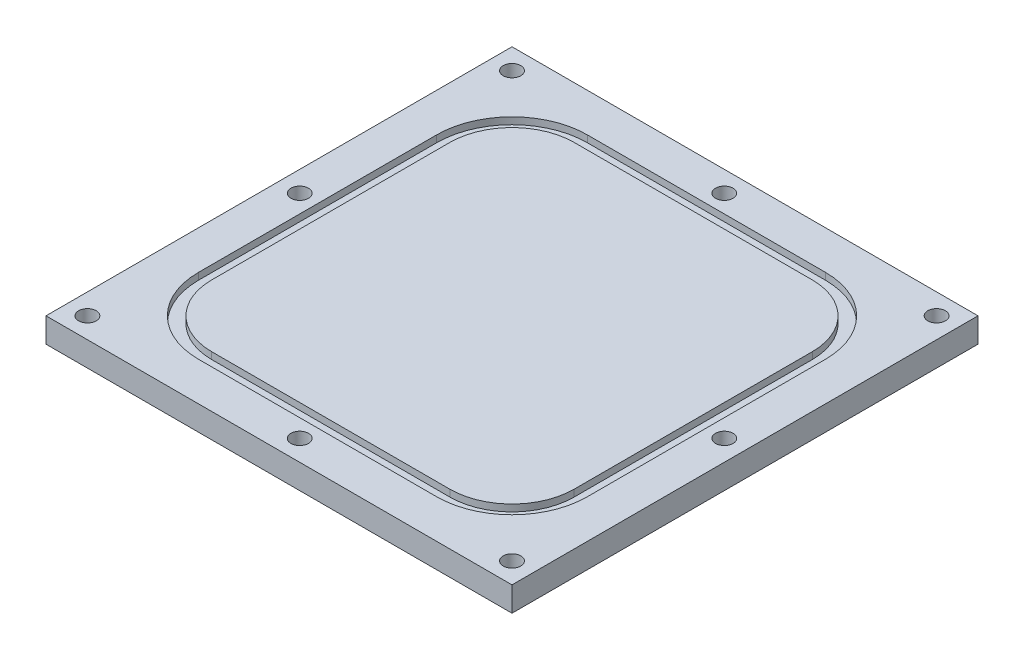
ISO-10303-21;
HEADER;
FILE_DESCRIPTION(('STEP AP214'),'2;1');
FILE_NAME('part.step','',(''),(''),'','','');
FILE_SCHEMA(('AUTOMOTIVE_DESIGN { 1 0 10303 214 1 1 1 1 }'));
ENDSEC;
DATA;
#1=APPLICATION_CONTEXT('core data for automotive mechanical design processes');
#2=APPLICATION_PROTOCOL_DEFINITION('international standard','automotive_design',2000,#1);
#3=PRODUCT_CONTEXT('',#1,'mechanical');
#4=PRODUCT('Part','Part','',(#3));
#5=PRODUCT_RELATED_PRODUCT_CATEGORY('part','',(#4));
#6=PRODUCT_DEFINITION_FORMATION('','',#4);
#7=PRODUCT_DEFINITION_CONTEXT('part definition',#1,'design');
#8=PRODUCT_DEFINITION('design','',#6,#7);
#9=PRODUCT_DEFINITION_SHAPE('','',#8);
#10=(LENGTH_UNIT() NAMED_UNIT(*) SI_UNIT(.MILLI.,.METRE.));
#11=(NAMED_UNIT(*) PLANE_ANGLE_UNIT() SI_UNIT($,.RADIAN.));
#12=(NAMED_UNIT(*) SI_UNIT($,.STERADIAN.) SOLID_ANGLE_UNIT());
#13=UNCERTAINTY_MEASURE_WITH_UNIT(LENGTH_MEASURE(1.E-05),#10,'distance_accuracy_value','');
#14=(GEOMETRIC_REPRESENTATION_CONTEXT(3) GLOBAL_UNCERTAINTY_ASSIGNED_CONTEXT((#13)) GLOBAL_UNIT_ASSIGNED_CONTEXT((#10,
#11,#12)) REPRESENTATION_CONTEXT('',''));
#15=CARTESIAN_POINT('',(0.,0.,0.));
#16=DIRECTION('',(0.,0.,1.));
#17=DIRECTION('',(1.,0.,0.));
#18=AXIS2_PLACEMENT_3D('',#15,#16,#17);
#19=CARTESIAN_POINT('',(45.0000000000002,4.7497999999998,45.0000000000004));
#20=DIRECTION('',(-1.,0.,0.));
#21=DIRECTION('',(0.,0.,1.));
#22=AXIS2_PLACEMENT_3D('',#19,#20,#21);
#23=PLANE('',#22);
#24=DIRECTION('',(0.,0.,-1.));
#25=VECTOR('',#24,1.);
#26=CARTESIAN_POINT('',(45.0000000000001,1.11022302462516E-13,45.0000000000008));
#27=LINE('',#26,#25);
#28=CARTESIAN_POINT('',(45.0000000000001,1.11022302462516E-13,45.0000000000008));
#29=VERTEX_POINT('',#28);
#30=CARTESIAN_POINT('',(45.0000000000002,2.22044604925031E-13,-44.9999999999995));
#31=VERTEX_POINT('',#30);
#32=EDGE_CURVE('E356',#29,#31,#27,.T.);
#33=ORIENTED_EDGE('',*,*,#32,.T.);
#34=DIRECTION('',(0.,-1.,0.));
#35=VECTOR('',#34,1.);
#36=CARTESIAN_POINT('',(45.0000000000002,4.7497999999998,-44.9999999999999));
#37=LINE('',#36,#35);
#38=CARTESIAN_POINT('',(45.0000000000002,4.7497999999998,-44.9999999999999));
#39=VERTEX_POINT('',#38);
#40=EDGE_CURVE('E11',#39,#31,#37,.T.);
#41=ORIENTED_EDGE('',*,*,#40,.F.);
#42=DIRECTION('',(0.,0.,-1.));
#43=VECTOR('',#42,1.);
#44=CARTESIAN_POINT('',(45.0000000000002,4.7497999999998,45.0000000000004));
#45=LINE('',#44,#43);
#46=CARTESIAN_POINT('',(45.0000000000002,4.7497999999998,45.0000000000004));
#47=VERTEX_POINT('',#46);
#48=EDGE_CURVE('E357',#47,#39,#45,.T.);
#49=ORIENTED_EDGE('',*,*,#48,.F.);
#50=DIRECTION('',(0.,-1.,0.));
#51=VECTOR('',#50,1.);
#52=CARTESIAN_POINT('',(45.0000000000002,4.7497999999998,45.0000000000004));
#53=LINE('',#52,#51);
#54=EDGE_CURVE('E367',#47,#29,#53,.T.);
#55=ORIENTED_EDGE('',*,*,#54,.T.);
#56=EDGE_LOOP('',(#33,#41,#49,#55));
#57=FACE_BOUND('',#56,.T.);
#58=ADVANCED_FACE('F36',(#57),#23,.F.);
#59=CARTESIAN_POINT('',(-45.0000000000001,4.74980000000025,-44.9999999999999));
#60=DIRECTION('',(0.,0.,1.));
#61=DIRECTION('',(1.,0.,0.));
#62=AXIS2_PLACEMENT_3D('',#59,#60,#61);
#63=PLANE('',#62);
#64=DIRECTION('',(-1.,0.,0.));
#65=VECTOR('',#64,1.);
#66=CARTESIAN_POINT('',(-45.0000000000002,6.66133814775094E-13,-44.9999999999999));
#67=LINE('',#66,#65);
#68=CARTESIAN_POINT('',(-45.0000000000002,6.66133814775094E-13,-44.9999999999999));
#69=VERTEX_POINT('',#68);
#70=EDGE_CURVE('E370',#31,#69,#67,.T.);
#71=ORIENTED_EDGE('',*,*,#70,.T.);
#72=DIRECTION('',(0.,-1.,0.));
#73=VECTOR('',#72,1.);
#74=CARTESIAN_POINT('',(-45.0000000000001,4.74980000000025,-44.9999999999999));
#75=LINE('',#74,#73);
#76=CARTESIAN_POINT('',(-45.0000000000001,4.74980000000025,-44.9999999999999));
#77=VERTEX_POINT('',#76);
#78=EDGE_CURVE('E43',#77,#69,#75,.T.);
#79=ORIENTED_EDGE('',*,*,#78,.F.);
#80=DIRECTION('',(-1.,0.,0.));
#81=VECTOR('',#80,1.);
#82=CARTESIAN_POINT('',(-45.0000000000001,4.74980000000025,-44.9999999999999));
#83=LINE('',#82,#81);
#84=EDGE_CURVE('E360',#39,#77,#83,.T.);
#85=ORIENTED_EDGE('',*,*,#84,.F.);
#86=ORIENTED_EDGE('',*,*,#40,.T.);
#87=EDGE_LOOP('',(#71,#79,#85,#86));
#88=FACE_BOUND('',#87,.T.);
#89=ADVANCED_FACE('F400',(#88),#63,.F.);
#90=CARTESIAN_POINT('',(-45.0000000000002,4.74980000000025,45.0000000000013));
#91=DIRECTION('',(1.,0.,0.));
#92=DIRECTION('',(0.,0.,-1.));
#93=AXIS2_PLACEMENT_3D('',#90,#91,#92);
#94=PLANE('',#93);
#95=DIRECTION('',(0.,0.,1.));
#96=VECTOR('',#95,1.);
#97=CARTESIAN_POINT('',(-45.0000000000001,1.11022302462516E-13,45.0000000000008));
#98=LINE('',#97,#96);
#99=CARTESIAN_POINT('',(-45.0000000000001,1.11022302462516E-13,45.0000000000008));
#100=VERTEX_POINT('',#99);
#101=EDGE_CURVE('E372',#69,#100,#98,.T.);
#102=ORIENTED_EDGE('',*,*,#101,.T.);
#103=DIRECTION('',(0.,-1.,0.));
#104=VECTOR('',#103,1.);
#105=CARTESIAN_POINT('',(-45.0000000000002,4.74980000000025,45.0000000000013));
#106=LINE('',#105,#104);
#107=CARTESIAN_POINT('',(-45.0000000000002,4.74980000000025,45.0000000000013));
#108=VERTEX_POINT('',#107);
#109=EDGE_CURVE('E377',#108,#100,#106,.T.);
#110=ORIENTED_EDGE('',*,*,#109,.F.);
#111=DIRECTION('',(0.,0.,1.));
#112=VECTOR('',#111,1.);
#113=CARTESIAN_POINT('',(-45.0000000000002,4.74980000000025,45.0000000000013));
#114=LINE('',#113,#112);
#115=EDGE_CURVE('E363',#77,#108,#114,.T.);
#116=ORIENTED_EDGE('',*,*,#115,.F.);
#117=ORIENTED_EDGE('',*,*,#78,.T.);
#118=EDGE_LOOP('',(#102,#110,#116,#117));
#119=FACE_BOUND('',#118,.T.);
#120=ADVANCED_FACE('F384',(#119),#94,.F.);
#121=CARTESIAN_POINT('',(-45.0000000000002,4.74980000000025,45.0000000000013));
#122=DIRECTION('',(0.,0.,-1.));
#123=DIRECTION('',(-1.,0.,0.));
#124=AXIS2_PLACEMENT_3D('',#121,#122,#123);
#125=PLANE('',#124);
#126=DIRECTION('',(1.,0.,0.));
#127=VECTOR('',#126,1.);
#128=CARTESIAN_POINT('',(-45.0000000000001,1.11022302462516E-13,45.0000000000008));
#129=LINE('',#128,#127);
#130=EDGE_CURVE('E361',#100,#29,#129,.T.);
#131=ORIENTED_EDGE('',*,*,#130,.T.);
#132=ORIENTED_EDGE('',*,*,#54,.F.);
#133=DIRECTION('',(1.,0.,0.));
#134=VECTOR('',#133,1.);
#135=CARTESIAN_POINT('',(-45.0000000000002,4.74980000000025,45.0000000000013));
#136=LINE('',#135,#134);
#137=EDGE_CURVE('E365',#108,#47,#136,.T.);
#138=ORIENTED_EDGE('',*,*,#137,.F.);
#139=ORIENTED_EDGE('',*,*,#109,.T.);
#140=EDGE_LOOP('',(#131,#132,#138,#139));
#141=FACE_BOUND('',#140,.T.);
#142=ADVANCED_FACE('F393',(#141),#125,.F.);
#143=CARTESIAN_POINT('',(45.0000000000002,4.7497999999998,-44.9999999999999));
#144=DIRECTION('',(0.,-1.,0.));
#145=DIRECTION('',(0.,0.,-1.));
#146=AXIS2_PLACEMENT_3D('',#143,#144,#145);
#147=PLANE('',#146);
#148=DIRECTION('',(0.,0.,-1.));
#149=VECTOR('',#148,1.);
#150=CARTESIAN_POINT('',(37.5400000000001,4.74979999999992,23.0000000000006));
#151=LINE('',#150,#149);
#152=CARTESIAN_POINT('',(37.5400000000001,4.74979999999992,23.0000000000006));
#153=VERTEX_POINT('',#152);
#154=CARTESIAN_POINT('',(37.5400000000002,4.74980000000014,-22.9999999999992));
#155=VERTEX_POINT('',#154);
#156=EDGE_CURVE('E273',#153,#155,#151,.T.);
#157=ORIENTED_EDGE('',*,*,#156,.F.);
#158=CARTESIAN_POINT('',(23.,4.7497999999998,23.000000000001));
#159=DIRECTION('',(0.,1.,0.));
#160=DIRECTION('',(0.,0.,1.));
#161=AXIS2_PLACEMENT_3D('',#158,#159,#160);
#162=CIRCLE('',#161,14.54);
#163=CARTESIAN_POINT('',(23.,4.74980000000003,37.5400000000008));
#164=VERTEX_POINT('',#163);
#165=EDGE_CURVE('E50',#164,#153,#162,.T.);
#166=ORIENTED_EDGE('',*,*,#165,.F.);
#167=DIRECTION('',(1.,0.,0.));
#168=VECTOR('',#167,1.);
#169=CARTESIAN_POINT('',(23.,4.74980000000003,37.5400000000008));
#170=LINE('',#169,#168);
#171=CARTESIAN_POINT('',(-23.,4.74979999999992,37.5399999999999));
#172=VERTEX_POINT('',#171);
#173=EDGE_CURVE('E250',#172,#164,#170,.T.);
#174=ORIENTED_EDGE('',*,*,#173,.F.);
#175=CARTESIAN_POINT('',(-23.0000000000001,4.74979999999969,23.0000000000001));
#176=DIRECTION('',(0.,1.,0.));
#177=DIRECTION('',(0.,0.,1.));
#178=AXIS2_PLACEMENT_3D('',#175,#176,#177);
#179=CIRCLE('',#178,14.54);
#180=CARTESIAN_POINT('',(-37.5400000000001,4.74979999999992,22.9999999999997));
#181=VERTEX_POINT('',#180);
#182=EDGE_CURVE('E288',#181,#172,#179,.T.);
#183=ORIENTED_EDGE('',*,*,#182,.F.);
#184=DIRECTION('',(0.,0.,1.));
#185=VECTOR('',#184,1.);
#186=CARTESIAN_POINT('',(-37.5400000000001,4.74979999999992,22.9999999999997));
#187=LINE('',#186,#185);
#188=CARTESIAN_POINT('',(-37.5400000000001,4.74979999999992,-22.9999999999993));
#189=VERTEX_POINT('',#188);
#190=EDGE_CURVE('E285',#189,#181,#187,.T.);
#191=ORIENTED_EDGE('',*,*,#190,.F.);
#192=CARTESIAN_POINT('',(-23.0000000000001,4.74980000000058,-22.9999999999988));
#193=DIRECTION('',(0.,1.,0.));
#194=DIRECTION('',(0.,0.,1.));
#195=AXIS2_PLACEMENT_3D('',#192,#193,#194);
#196=CIRCLE('',#195,14.54);
#197=CARTESIAN_POINT('',(-23.0000000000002,4.74979999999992,-37.539999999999));
#198=VERTEX_POINT('',#197);
#199=EDGE_CURVE('E282',#198,#189,#196,.T.);
#200=ORIENTED_EDGE('',*,*,#199,.F.);
#201=DIRECTION('',(-1.,0.,0.));
#202=VECTOR('',#201,1.);
#203=CARTESIAN_POINT('',(23.,4.74980000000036,-37.5399999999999));
#204=LINE('',#203,#202);
#205=CARTESIAN_POINT('',(23.,4.74980000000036,-37.5399999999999));
#206=VERTEX_POINT('',#205);
#207=EDGE_CURVE('E279',#206,#198,#204,.T.);
#208=ORIENTED_EDGE('',*,*,#207,.F.);
#209=CARTESIAN_POINT('',(22.9999999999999,4.74980000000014,-23.0000000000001));
#210=DIRECTION('',(0.,1.,0.));
#211=DIRECTION('',(0.,0.,1.));
#212=AXIS2_PLACEMENT_3D('',#209,#210,#211);
#213=CIRCLE('',#212,14.54);
#214=EDGE_CURVE('E276',#155,#206,#213,.T.);
#215=ORIENTED_EDGE('',*,*,#214,.F.);
#216=EDGE_LOOP('',(#157,#166,#174,#183,#191,#200,#208,#215));
#217=FACE_BOUND('',#216,.T.);
#218=CARTESIAN_POINT('',(-41.0000000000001,4.74980000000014,41.0000000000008));
#219=DIRECTION('',(0.,-1.,0.));
#220=DIRECTION('',(0.,0.,-1.));
#221=AXIS2_PLACEMENT_3D('',#218,#219,#220);
#222=CIRCLE('',#221,1.7);
#223=CARTESIAN_POINT('',(-41.0000000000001,4.74980000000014,39.3000000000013));
#224=VERTEX_POINT('',#223);
#225=EDGE_CURVE('E311',#224,#224,#222,.T.);
#226=ORIENTED_EDGE('',*,*,#225,.T.);
#227=EDGE_LOOP('',(#226));
#228=FACE_BOUND('',#227,.T.);
#229=CARTESIAN_POINT('',(0.,4.7497999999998,41.0000000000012));
#230=DIRECTION('',(0.,-1.,0.));
#231=DIRECTION('',(0.,0.,-1.));
#232=AXIS2_PLACEMENT_3D('',#229,#230,#231);
#233=CIRCLE('',#232,1.7);
#234=CARTESIAN_POINT('',(0.,4.7497999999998,39.3000000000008));
#235=VERTEX_POINT('',#234);
#236=EDGE_CURVE('E317',#235,#235,#233,.T.);
#237=ORIENTED_EDGE('',*,*,#236,.T.);
#238=EDGE_LOOP('',(#237));
#239=FACE_BOUND('',#238,.T.);
#240=CARTESIAN_POINT('',(41.0000000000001,4.74980000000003,41.0000000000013));
#241=DIRECTION('',(0.,-1.,0.));
#242=DIRECTION('',(0.,0.,-1.));
#243=AXIS2_PLACEMENT_3D('',#240,#241,#242);
#244=CIRCLE('',#243,1.7);
#245=CARTESIAN_POINT('',(41.,4.74980000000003,39.3000000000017));
#246=VERTEX_POINT('',#245);
#247=EDGE_CURVE('E323',#246,#246,#244,.T.);
#248=ORIENTED_EDGE('',*,*,#247,.T.);
#249=EDGE_LOOP('',(#248));
#250=FACE_BOUND('',#249,.T.);
#251=CARTESIAN_POINT('',(41.0000000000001,4.74980000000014,4.44089209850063E-13));
#252=DIRECTION('',(0.,-1.,0.));
#253=DIRECTION('',(0.,0.,-1.));
#254=AXIS2_PLACEMENT_3D('',#251,#252,#253);
#255=CIRCLE('',#254,1.7);
#256=CARTESIAN_POINT('',(41.,4.74980000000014,-1.69999999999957));
#257=VERTEX_POINT('',#256);
#258=EDGE_CURVE('E329',#257,#257,#255,.T.);
#259=ORIENTED_EDGE('',*,*,#258,.T.);
#260=EDGE_LOOP('',(#259));
#261=FACE_BOUND('',#260,.T.);
#262=CARTESIAN_POINT('',(41.0000000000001,4.74980000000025,-41.0000000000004));
#263=DIRECTION('',(0.,-1.,0.));
#264=DIRECTION('',(0.,0.,-1.));
#265=AXIS2_PLACEMENT_3D('',#262,#263,#264);
#266=CIRCLE('',#265,1.7);
#267=CARTESIAN_POINT('',(41.,4.74980000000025,-42.6999999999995));
#268=VERTEX_POINT('',#267);
#269=EDGE_CURVE('E335',#268,#268,#266,.T.);
#270=ORIENTED_EDGE('',*,*,#269,.T.);
#271=EDGE_LOOP('',(#270));
#272=FACE_BOUND('',#271,.T.);
#273=CARTESIAN_POINT('',(0.,4.74980000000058,-41.0000000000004));
#274=DIRECTION('',(0.,-1.,0.));
#275=DIRECTION('',(0.,0.,-1.));
#276=AXIS2_PLACEMENT_3D('',#273,#274,#275);
#277=CIRCLE('',#276,1.7);
#278=CARTESIAN_POINT('',(0.,4.74980000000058,-42.6999999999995));
#279=VERTEX_POINT('',#278);
#280=EDGE_CURVE('E341',#279,#279,#277,.T.);
#281=ORIENTED_EDGE('',*,*,#280,.T.);
#282=EDGE_LOOP('',(#281));
#283=FACE_BOUND('',#282,.T.);
#284=CARTESIAN_POINT('',(-41.0000000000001,4.74980000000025,-40.9999999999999));
#285=DIRECTION('',(0.,-1.,0.));
#286=DIRECTION('',(0.,0.,-1.));
#287=AXIS2_PLACEMENT_3D('',#284,#285,#286);
#288=CIRCLE('',#287,1.7);
#289=CARTESIAN_POINT('',(-41.0000000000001,4.74980000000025,-42.6999999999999));
#290=VERTEX_POINT('',#289);
#291=EDGE_CURVE('E347',#290,#290,#288,.T.);
#292=ORIENTED_EDGE('',*,*,#291,.T.);
#293=EDGE_LOOP('',(#292));
#294=FACE_BOUND('',#293,.T.);
#295=CARTESIAN_POINT('',(-41.0000000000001,4.74980000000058,1.33226762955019E-12));
#296=DIRECTION('',(0.,-1.,0.));
#297=DIRECTION('',(0.,0.,-1.));
#298=AXIS2_PLACEMENT_3D('',#295,#296,#297);
#299=CIRCLE('',#298,1.7);
#300=CARTESIAN_POINT('',(-41.0000000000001,4.74980000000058,-1.70000000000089));
#301=VERTEX_POINT('',#300);
#302=EDGE_CURVE('E353',#301,#301,#299,.T.);
#303=ORIENTED_EDGE('',*,*,#302,.T.);
#304=EDGE_LOOP('',(#303));
#305=FACE_BOUND('',#304,.T.);
#306=ORIENTED_EDGE('',*,*,#48,.T.);
#307=ORIENTED_EDGE('',*,*,#84,.T.);
#308=ORIENTED_EDGE('',*,*,#115,.T.);
#309=ORIENTED_EDGE('',*,*,#137,.T.);
#310=EDGE_LOOP('',(#306,#307,#308,#309));
#311=FACE_BOUND('',#310,.T.);
#312=ADVANCED_FACE('F399',(#217,#228,#239,#250,#261,#272,#283,#294,#305,#311),#147,.F.);
#313=CARTESIAN_POINT('',(45.0000000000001,2.22044604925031E-13,-44.9999999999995));
#314=DIRECTION('',(0.,-1.,0.));
#315=DIRECTION('',(0.,0.,-1.));
#316=AXIS2_PLACEMENT_3D('',#313,#314,#315);
#317=PLANE('',#316);
#318=CARTESIAN_POINT('',(-41.0000000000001,-3.33066907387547E-13,41.0000000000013));
#319=DIRECTION('',(0.,-1.,0.));
#320=DIRECTION('',(0.,0.,-1.));
#321=AXIS2_PLACEMENT_3D('',#318,#319,#320);
#322=CIRCLE('',#321,1.7);
#323=CARTESIAN_POINT('',(-41.0000000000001,-3.33208460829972E-13,39.3000000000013));
#324=VERTEX_POINT('',#323);
#325=EDGE_CURVE('E295',#324,#324,#322,.T.);
#326=ORIENTED_EDGE('',*,*,#325,.F.);
#327=EDGE_LOOP('',(#326));
#328=FACE_BOUND('',#327,.T.);
#329=CARTESIAN_POINT('',(0.,-1.11022302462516E-13,41.0000000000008));
#330=DIRECTION('',(0.,-1.,0.));
#331=DIRECTION('',(0.,0.,-1.));
#332=AXIS2_PLACEMENT_3D('',#329,#330,#331);
#333=CIRCLE('',#332,1.7);
#334=CARTESIAN_POINT('',(0.,-1.1116385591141E-13,39.3000000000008));
#335=VERTEX_POINT('',#334);
#336=EDGE_CURVE('E314',#335,#335,#333,.T.);
#337=ORIENTED_EDGE('',*,*,#336,.F.);
#338=EDGE_LOOP('',(#337));
#339=FACE_BOUND('',#338,.T.);
#340=CARTESIAN_POINT('',(41.,-4.44089209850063E-13,41.0000000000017));
#341=DIRECTION('',(0.,-1.,0.));
#342=DIRECTION('',(0.,0.,-1.));
#343=AXIS2_PLACEMENT_3D('',#340,#341,#342);
#344=CIRCLE('',#343,1.7);
#345=CARTESIAN_POINT('',(41.,-4.44230763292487E-13,39.3000000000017));
#346=VERTEX_POINT('',#345);
#347=EDGE_CURVE('E320',#346,#346,#344,.T.);
#348=ORIENTED_EDGE('',*,*,#347,.F.);
#349=EDGE_LOOP('',(#348));
#350=FACE_BOUND('',#349,.T.);
#351=CARTESIAN_POINT('',(41.,-3.33066907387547E-13,4.30211422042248E-13));
#352=DIRECTION('',(0.,-1.,0.));
#353=DIRECTION('',(0.,0.,-1.));
#354=AXIS2_PLACEMENT_3D('',#351,#352,#353);
#355=CIRCLE('',#354,1.7);
#356=CARTESIAN_POINT('',(41.,-3.33208460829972E-13,-1.69999999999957));
#357=VERTEX_POINT('',#356);
#358=EDGE_CURVE('E326',#357,#357,#355,.T.);
#359=ORIENTED_EDGE('',*,*,#358,.F.);
#360=EDGE_LOOP('',(#359));
#361=FACE_BOUND('',#360,.T.);
#362=CARTESIAN_POINT('',(41.,1.11022302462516E-13,-40.9999999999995));
#363=DIRECTION('',(0.,-1.,0.));
#364=DIRECTION('',(0.,0.,-1.));
#365=AXIS2_PLACEMENT_3D('',#362,#363,#364);
#366=CIRCLE('',#365,1.7);
#367=CARTESIAN_POINT('',(41.,1.10880749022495E-13,-42.6999999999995));
#368=VERTEX_POINT('',#367);
#369=EDGE_CURVE('E332',#368,#368,#366,.T.);
#370=ORIENTED_EDGE('',*,*,#369,.F.);
#371=EDGE_LOOP('',(#370));
#372=FACE_BOUND('',#371,.T.);
#373=CARTESIAN_POINT('',(0.,6.66133814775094E-13,-40.9999999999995));
#374=DIRECTION('',(0.,-1.,0.));
#375=DIRECTION('',(0.,0.,-1.));
#376=AXIS2_PLACEMENT_3D('',#373,#374,#375);
#377=CIRCLE('',#376,1.7);
#378=CARTESIAN_POINT('',(0.,6.65992261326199E-13,-42.6999999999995));
#379=VERTEX_POINT('',#378);
#380=EDGE_CURVE('E338',#379,#379,#377,.T.);
#381=ORIENTED_EDGE('',*,*,#380,.F.);
#382=EDGE_LOOP('',(#381));
#383=FACE_BOUND('',#382,.T.);
#384=CARTESIAN_POINT('',(-41.0000000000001,4.44089209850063E-13,-40.9999999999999));
#385=DIRECTION('',(0.,-1.,0.));
#386=DIRECTION('',(0.,0.,-1.));
#387=AXIS2_PLACEMENT_3D('',#384,#385,#386);
#388=CIRCLE('',#387,1.7);
#389=CARTESIAN_POINT('',(-41.0000000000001,4.43947656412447E-13,-42.6999999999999));
#390=VERTEX_POINT('',#389);
#391=EDGE_CURVE('E344',#390,#390,#388,.T.);
#392=ORIENTED_EDGE('',*,*,#391,.F.);
#393=EDGE_LOOP('',(#392));
#394=FACE_BOUND('',#393,.T.);
#395=CARTESIAN_POINT('',(-41.0000000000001,1.11022302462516E-13,-8.88178419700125E-13));
#396=DIRECTION('',(0.,-1.,0.));
#397=DIRECTION('',(0.,0.,-1.));
#398=AXIS2_PLACEMENT_3D('',#395,#396,#397);
#399=CIRCLE('',#398,1.7);
#400=CARTESIAN_POINT('',(-41.0000000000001,1.10880749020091E-13,-1.70000000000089));
#401=VERTEX_POINT('',#400);
#402=EDGE_CURVE('E350',#401,#401,#399,.T.);
#403=ORIENTED_EDGE('',*,*,#402,.F.);
#404=EDGE_LOOP('',(#403));
#405=FACE_BOUND('',#404,.T.);
#406=ORIENTED_EDGE('',*,*,#32,.F.);
#407=ORIENTED_EDGE('',*,*,#130,.F.);
#408=ORIENTED_EDGE('',*,*,#101,.F.);
#409=ORIENTED_EDGE('',*,*,#70,.F.);
#410=EDGE_LOOP('',(#406,#407,#408,#409));
#411=FACE_BOUND('',#410,.T.);
#412=ADVANCED_FACE('F390',(#328,#339,#350,#361,#372,#383,#394,#405,#411),#317,.T.);
#413=CARTESIAN_POINT('',(-41.0000000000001,1.11022302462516E-13,-8.88178419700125E-13));
#414=DIRECTION('',(0.,-1.,0.));
#415=DIRECTION('',(0.,0.,-1.));
#416=AXIS2_PLACEMENT_3D('',#413,#414,#415);
#417=CYLINDRICAL_SURFACE('',#416,1.7);
#418=CARTESIAN_POINT('',(-41.0000000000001,4.74980000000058,-1.70000000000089));
#419=CARTESIAN_POINT('',(-41.0000000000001,4.70032291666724,-1.70000000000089));
#420=CARTESIAN_POINT('',(-41.0000000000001,4.6508458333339,-1.70000000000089));
#421=CARTESIAN_POINT('',(-41.0000000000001,4.55189166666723,-1.70000000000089));
#422=CARTESIAN_POINT('',(-41.0000000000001,4.50241458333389,-1.70000000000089));
#423=CARTESIAN_POINT('',(-41.0000000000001,4.40346041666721,-1.70000000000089));
#424=CARTESIAN_POINT('',(-41.0000000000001,4.35398333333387,-1.70000000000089));
#425=CARTESIAN_POINT('',(-41.0000000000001,4.2550291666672,-1.70000000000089));
#426=CARTESIAN_POINT('',(-41.0000000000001,4.20555208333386,-1.70000000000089));
#427=CARTESIAN_POINT('',(-41.0000000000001,4.10659791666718,-1.70000000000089));
#428=CARTESIAN_POINT('',(-41.0000000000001,4.05712083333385,-1.70000000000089));
#429=CARTESIAN_POINT('',(-41.0000000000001,3.95816666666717,-1.70000000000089));
#430=CARTESIAN_POINT('',(-41.0000000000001,3.90868958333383,-1.70000000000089));
#431=CARTESIAN_POINT('',(-41.0000000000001,3.80973541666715,-1.70000000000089));
#432=CARTESIAN_POINT('',(-41.0000000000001,3.76025833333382,-1.70000000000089));
#433=CARTESIAN_POINT('',(-41.0000000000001,3.66130416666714,-1.70000000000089));
#434=CARTESIAN_POINT('',(-41.0000000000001,3.6118270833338,-1.70000000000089));
#435=CARTESIAN_POINT('',(-41.0000000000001,3.51287291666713,-1.70000000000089));
#436=CARTESIAN_POINT('',(-41.0000000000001,3.46339583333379,-1.70000000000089));
#437=CARTESIAN_POINT('',(-41.0000000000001,3.36444166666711,-1.70000000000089));
#438=CARTESIAN_POINT('',(-41.0000000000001,3.31496458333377,-1.70000000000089));
#439=CARTESIAN_POINT('',(-41.0000000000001,3.2160104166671,-1.70000000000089));
#440=CARTESIAN_POINT('',(-41.0000000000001,3.16653333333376,-1.70000000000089));
#441=CARTESIAN_POINT('',(-41.0000000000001,3.06757916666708,-1.70000000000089));
#442=CARTESIAN_POINT('',(-41.0000000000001,3.01810208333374,-1.70000000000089));
#443=CARTESIAN_POINT('',(-41.0000000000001,2.91914791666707,-1.70000000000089));
#444=CARTESIAN_POINT('',(-41.0000000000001,2.86967083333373,-1.70000000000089));
#445=CARTESIAN_POINT('',(-41.0000000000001,2.77071666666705,-1.70000000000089));
#446=CARTESIAN_POINT('',(-41.0000000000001,2.72123958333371,-1.70000000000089));
#447=CARTESIAN_POINT('',(-41.0000000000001,2.62228541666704,-1.70000000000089));
#448=CARTESIAN_POINT('',(-41.0000000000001,2.5728083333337,-1.70000000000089));
#449=CARTESIAN_POINT('',(-41.0000000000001,2.47385416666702,-1.70000000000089));
#450=CARTESIAN_POINT('',(-41.0000000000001,2.42437708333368,-1.70000000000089));
#451=CARTESIAN_POINT('',(-41.0000000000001,2.32542291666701,-1.70000000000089));
#452=CARTESIAN_POINT('',(-41.0000000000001,2.27594583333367,-1.70000000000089));
#453=CARTESIAN_POINT('',(-41.0000000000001,2.17699166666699,-1.70000000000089));
#454=CARTESIAN_POINT('',(-41.0000000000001,2.12751458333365,-1.70000000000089));
#455=CARTESIAN_POINT('',(-41.0000000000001,2.02856041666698,-1.70000000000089));
#456=CARTESIAN_POINT('',(-41.0000000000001,1.97908333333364,-1.70000000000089));
#457=CARTESIAN_POINT('',(-41.0000000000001,1.88012916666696,-1.70000000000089));
#458=CARTESIAN_POINT('',(-41.0000000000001,1.83065208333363,-1.70000000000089));
#459=CARTESIAN_POINT('',(-41.0000000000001,1.73169791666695,-1.70000000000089));
#460=CARTESIAN_POINT('',(-41.0000000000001,1.68222083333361,-1.70000000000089));
#461=CARTESIAN_POINT('',(-41.0000000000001,1.58326666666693,-1.70000000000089));
#462=CARTESIAN_POINT('',(-41.0000000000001,1.5337895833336,-1.70000000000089));
#463=CARTESIAN_POINT('',(-41.0000000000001,1.43483541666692,-1.70000000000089));
#464=CARTESIAN_POINT('',(-41.0000000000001,1.38535833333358,-1.70000000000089));
#465=CARTESIAN_POINT('',(-41.0000000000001,1.28640416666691,-1.70000000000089));
#466=CARTESIAN_POINT('',(-41.0000000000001,1.23692708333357,-1.70000000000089));
#467=CARTESIAN_POINT('',(-41.0000000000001,1.13797291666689,-1.70000000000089));
#468=CARTESIAN_POINT('',(-41.0000000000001,1.08849583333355,-1.70000000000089));
#469=CARTESIAN_POINT('',(-41.0000000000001,0.989541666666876,-1.70000000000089));
#470=CARTESIAN_POINT('',(-41.0000000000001,0.940064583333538,-1.70000000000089));
#471=CARTESIAN_POINT('',(-41.0000000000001,0.841110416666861,-1.70000000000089));
#472=CARTESIAN_POINT('',(-41.0000000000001,0.791633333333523,-1.70000000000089));
#473=CARTESIAN_POINT('',(-41.0000000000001,0.692679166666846,-1.70000000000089));
#474=CARTESIAN_POINT('',(-41.0000000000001,0.643202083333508,-1.70000000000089));
#475=CARTESIAN_POINT('',(-41.0000000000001,0.544247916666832,-1.70000000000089));
#476=CARTESIAN_POINT('',(-41.0000000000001,0.494770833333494,-1.70000000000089));
#477=CARTESIAN_POINT('',(-41.0000000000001,0.395816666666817,-1.70000000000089));
#478=CARTESIAN_POINT('',(-41.0000000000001,0.346339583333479,-1.70000000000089));
#479=CARTESIAN_POINT('',(-41.0000000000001,0.247385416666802,-1.70000000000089));
#480=CARTESIAN_POINT('',(-41.0000000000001,0.197908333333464,-1.70000000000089));
#481=CARTESIAN_POINT('',(-41.0000000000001,0.0989541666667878,-1.70000000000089));
#482=CARTESIAN_POINT('',(-41.0000000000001,0.0494770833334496,-1.70000000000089));
#483=CARTESIAN_POINT('',(-41.0000000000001,1.11305409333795E-13,-1.70000000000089));
#484=B_SPLINE_CURVE_WITH_KNOTS('',3,(#418,#419,#420,#421,#422,#423,#424,#425,#426,#427,#428,
#429,#430,#431,#432,#433,#434,#435,#436,#437,#438,#439,#440,#441,#442,#443,#444,#445,#446,#447,
#448,#449,#450,#451,#452,#453,#454,#455,#456,#457,#458,#459,#460,#461,#462,#463,#464,#465,#466,
#467,#468,#469,#470,#471,#472,#473,#474,#475,#476,#477,#478,#479,#480,#481,#482,#483),
.UNSPECIFIED.,.F.,.F.,(4,2,2,2,2,2,2,2,2,2,2,2,2,2,2,2,2,2,2,2,2,2,2,2,2,2,2,2,2,2,2,2,4),(0.,
0.148431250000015,0.296862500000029,0.445293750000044,0.593725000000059,0.742156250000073,
0.890587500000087,1.0390187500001,1.18745000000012,1.33588125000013,1.48431250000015,
1.63274375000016,1.78117500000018,1.92960625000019,2.0780375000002,2.22646875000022,
2.37490000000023,2.52333125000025,2.67176250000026,2.82019375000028,2.96862500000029,
3.11705625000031,3.26548750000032,3.41391875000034,3.56235000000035,3.71078125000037,
3.85921250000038,4.0076437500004,4.15607500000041,4.30450625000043,4.45293750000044,
4.60136875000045,4.74980000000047),.UNSPECIFIED.);
#485=EDGE_CURVE('BSEAM412',#301,#401,#484,.T.);
#486=ORIENTED_EDGE('',*,*,#302,.F.);
#487=ORIENTED_EDGE('',*,*,#402,.T.);
#488=ORIENTED_EDGE('',*,*,#485,.T.);
#489=ORIENTED_EDGE('',*,*,#485,.F.);
#490=EDGE_LOOP('',(#486,#488,#487,#489));
#491=FACE_BOUND('',#490,.T.);
#492=ADVANCED_FACE('F412',(#491),#417,.F.);
#493=CARTESIAN_POINT('',(-41.0000000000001,4.44089209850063E-13,-40.9999999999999));
#494=DIRECTION('',(0.,-1.,0.));
#495=DIRECTION('',(0.,0.,-1.));
#496=AXIS2_PLACEMENT_3D('',#493,#494,#495);
#497=CYLINDRICAL_SURFACE('',#496,1.7);
#498=CARTESIAN_POINT('',(-41.0000000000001,4.74980000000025,-42.6999999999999));
#499=CARTESIAN_POINT('',(-41.0000000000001,4.70032291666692,-42.6999999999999));
#500=CARTESIAN_POINT('',(-41.0000000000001,4.65084583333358,-42.6999999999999));
#501=CARTESIAN_POINT('',(-41.0000000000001,4.55189166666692,-42.6999999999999));
#502=CARTESIAN_POINT('',(-41.0000000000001,4.50241458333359,-42.6999999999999));
#503=CARTESIAN_POINT('',(-41.0000000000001,4.40346041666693,-42.6999999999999));
#504=CARTESIAN_POINT('',(-41.0000000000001,4.3539833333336,-42.6999999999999));
#505=CARTESIAN_POINT('',(-41.0000000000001,4.25502916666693,-42.6999999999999));
#506=CARTESIAN_POINT('',(-41.0000000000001,4.2055520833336,-42.6999999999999));
#507=CARTESIAN_POINT('',(-41.0000000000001,4.10659791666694,-42.6999999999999));
#508=CARTESIAN_POINT('',(-41.0000000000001,4.05712083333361,-42.6999999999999));
#509=CARTESIAN_POINT('',(-41.0000000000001,3.95816666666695,-42.6999999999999));
#510=CARTESIAN_POINT('',(-41.0000000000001,3.90868958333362,-42.6999999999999));
#511=CARTESIAN_POINT('',(-41.0000000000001,3.80973541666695,-42.6999999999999));
#512=CARTESIAN_POINT('',(-41.0000000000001,3.76025833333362,-42.6999999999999));
#513=CARTESIAN_POINT('',(-41.0000000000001,3.66130416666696,-42.6999999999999));
#514=CARTESIAN_POINT('',(-41.0000000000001,3.61182708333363,-42.6999999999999));
#515=CARTESIAN_POINT('',(-41.0000000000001,3.51287291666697,-42.6999999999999));
#516=CARTESIAN_POINT('',(-41.0000000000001,3.46339583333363,-42.6999999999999));
#517=CARTESIAN_POINT('',(-41.0000000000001,3.36444166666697,-42.6999999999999));
#518=CARTESIAN_POINT('',(-41.0000000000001,3.31496458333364,-42.6999999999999));
#519=CARTESIAN_POINT('',(-41.0000000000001,3.21601041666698,-42.6999999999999));
#520=CARTESIAN_POINT('',(-41.0000000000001,3.16653333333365,-42.6999999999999));
#521=CARTESIAN_POINT('',(-41.0000000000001,3.06757916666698,-42.6999999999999));
#522=CARTESIAN_POINT('',(-41.0000000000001,3.01810208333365,-42.6999999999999));
#523=CARTESIAN_POINT('',(-41.0000000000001,2.91914791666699,-42.6999999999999));
#524=CARTESIAN_POINT('',(-41.0000000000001,2.86967083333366,-42.6999999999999));
#525=CARTESIAN_POINT('',(-41.0000000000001,2.770716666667,-42.6999999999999));
#526=CARTESIAN_POINT('',(-41.0000000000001,2.72123958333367,-42.6999999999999));
#527=CARTESIAN_POINT('',(-41.0000000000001,2.622285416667,-42.6999999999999));
#528=CARTESIAN_POINT('',(-41.0000000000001,2.57280833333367,-42.6999999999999));
#529=CARTESIAN_POINT('',(-41.0000000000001,2.47385416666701,-42.6999999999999));
#530=CARTESIAN_POINT('',(-41.0000000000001,2.42437708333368,-42.6999999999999));
#531=CARTESIAN_POINT('',(-41.0000000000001,2.32542291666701,-42.6999999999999));
#532=CARTESIAN_POINT('',(-41.0000000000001,2.27594583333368,-42.6999999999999));
#533=CARTESIAN_POINT('',(-41.0000000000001,2.17699166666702,-42.6999999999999));
#534=CARTESIAN_POINT('',(-41.0000000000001,2.12751458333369,-42.6999999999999));
#535=CARTESIAN_POINT('',(-41.0000000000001,2.02856041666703,-42.6999999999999));
#536=CARTESIAN_POINT('',(-41.0000000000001,1.9790833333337,-42.6999999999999));
#537=CARTESIAN_POINT('',(-41.0000000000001,1.88012916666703,-42.6999999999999));
#538=CARTESIAN_POINT('',(-41.0000000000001,1.8306520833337,-42.6999999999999));
#539=CARTESIAN_POINT('',(-41.0000000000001,1.73169791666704,-42.6999999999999));
#540=CARTESIAN_POINT('',(-41.0000000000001,1.68222083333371,-42.6999999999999));
#541=CARTESIAN_POINT('',(-41.0000000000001,1.58326666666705,-42.6999999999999));
#542=CARTESIAN_POINT('',(-41.0000000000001,1.53378958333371,-42.6999999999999));
#543=CARTESIAN_POINT('',(-41.0000000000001,1.43483541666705,-42.6999999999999));
#544=CARTESIAN_POINT('',(-41.0000000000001,1.38535833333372,-42.6999999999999));
#545=CARTESIAN_POINT('',(-41.0000000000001,1.28640416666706,-42.6999999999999));
#546=CARTESIAN_POINT('',(-41.0000000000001,1.23692708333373,-42.6999999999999));
#547=CARTESIAN_POINT('',(-41.0000000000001,1.13797291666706,-42.6999999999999));
#548=CARTESIAN_POINT('',(-41.0000000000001,1.08849583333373,-42.6999999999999));
#549=CARTESIAN_POINT('',(-41.0000000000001,0.98954166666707,-42.6999999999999));
#550=CARTESIAN_POINT('',(-41.0000000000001,0.940064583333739,-42.6999999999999));
#551=CARTESIAN_POINT('',(-41.0000000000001,0.841110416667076,-42.6999999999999));
#552=CARTESIAN_POINT('',(-41.0000000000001,0.791633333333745,-42.6999999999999));
#553=CARTESIAN_POINT('',(-41.0000000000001,0.692679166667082,-42.6999999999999));
#554=CARTESIAN_POINT('',(-41.0000000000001,0.643202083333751,-42.6999999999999));
#555=CARTESIAN_POINT('',(-41.0000000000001,0.544247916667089,-42.6999999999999));
#556=CARTESIAN_POINT('',(-41.0000000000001,0.494770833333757,-42.6999999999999));
#557=CARTESIAN_POINT('',(-41.0000000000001,0.395816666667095,-42.6999999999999));
#558=CARTESIAN_POINT('',(-41.0000000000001,0.346339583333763,-42.6999999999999));
#559=CARTESIAN_POINT('',(-41.0000000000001,0.247385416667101,-42.6999999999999));
#560=CARTESIAN_POINT('',(-41.0000000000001,0.197908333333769,-42.6999999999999));
#561=CARTESIAN_POINT('',(-41.0000000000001,0.098954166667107,-42.6999999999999));
#562=CARTESIAN_POINT('',(-41.0000000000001,0.0494770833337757,-42.6999999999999));
#563=CARTESIAN_POINT('',(-41.0000000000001,4.44372316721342E-13,-42.6999999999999));
#564=B_SPLINE_CURVE_WITH_KNOTS('',3,(#498,#499,#500,#501,#502,#503,#504,#505,#506,#507,#508,
#509,#510,#511,#512,#513,#514,#515,#516,#517,#518,#519,#520,#521,#522,#523,#524,#525,#526,#527,
#528,#529,#530,#531,#532,#533,#534,#535,#536,#537,#538,#539,#540,#541,#542,#543,#544,#545,#546,
#547,#548,#549,#550,#551,#552,#553,#554,#555,#556,#557,#558,#559,#560,#561,#562,#563),
.UNSPECIFIED.,.F.,.F.,(4,2,2,2,2,2,2,2,2,2,2,2,2,2,2,2,2,2,2,2,2,2,2,2,2,2,2,2,2,2,2,2,4),(0.,
0.148431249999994,0.296862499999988,0.445293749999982,0.593724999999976,0.742156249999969,
0.890587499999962,1.03901874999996,1.18744999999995,1.33588124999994,1.48431249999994,
1.63274374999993,1.78117499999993,1.92960624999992,2.07803749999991,2.22646874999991,
2.3748999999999,2.5233312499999,2.67176249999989,2.82019374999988,2.96862499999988,
3.11705624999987,3.26548749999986,3.41391874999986,3.56234999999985,3.71078124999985,
3.85921249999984,4.00764374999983,4.15607499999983,4.30450624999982,4.45293749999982,
4.60136874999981,4.7497999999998),.UNSPECIFIED.);
#565=EDGE_CURVE('BSEAM420',#290,#390,#564,.T.);
#566=ORIENTED_EDGE('',*,*,#291,.F.);
#567=ORIENTED_EDGE('',*,*,#391,.T.);
#568=ORIENTED_EDGE('',*,*,#565,.T.);
#569=ORIENTED_EDGE('',*,*,#565,.F.);
#570=EDGE_LOOP('',(#566,#568,#567,#569));
#571=FACE_BOUND('',#570,.T.);
#572=ADVANCED_FACE('F420',(#571),#497,.F.);
#573=CARTESIAN_POINT('',(0.,6.66133814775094E-13,-40.9999999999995));
#574=DIRECTION('',(0.,-1.,0.));
#575=DIRECTION('',(0.,0.,-1.));
#576=AXIS2_PLACEMENT_3D('',#573,#574,#575);
#577=CYLINDRICAL_SURFACE('',#576,1.7);
#578=CARTESIAN_POINT('',(0.,4.74980000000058,-42.6999999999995));
#579=CARTESIAN_POINT('',(0.,4.70032291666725,-42.6999999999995));
#580=CARTESIAN_POINT('',(0.,4.65084583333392,-42.6999999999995));
#581=CARTESIAN_POINT('',(0.,4.55189166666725,-42.6999999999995));
#582=CARTESIAN_POINT('',(0.,4.50241458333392,-42.6999999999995));
#583=CARTESIAN_POINT('',(0.,4.40346041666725,-42.6999999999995));
#584=CARTESIAN_POINT('',(0.,4.35398333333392,-42.6999999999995));
#585=CARTESIAN_POINT('',(0.,4.25502916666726,-42.6999999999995));
#586=CARTESIAN_POINT('',(0.,4.20555208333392,-42.6999999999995));
#587=CARTESIAN_POINT('',(0.,4.10659791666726,-42.6999999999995));
#588=CARTESIAN_POINT('',(0.,4.05712083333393,-42.6999999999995));
#589=CARTESIAN_POINT('',(0.,3.95816666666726,-42.6999999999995));
#590=CARTESIAN_POINT('',(0.,3.90868958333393,-42.6999999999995));
#591=CARTESIAN_POINT('',(0.,3.80973541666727,-42.6999999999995));
#592=CARTESIAN_POINT('',(0.,3.76025833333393,-42.6999999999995));
#593=CARTESIAN_POINT('',(0.,3.66130416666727,-42.6999999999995));
#594=CARTESIAN_POINT('',(0.,3.61182708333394,-42.6999999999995));
#595=CARTESIAN_POINT('',(0.,3.51287291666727,-42.6999999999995));
#596=CARTESIAN_POINT('',(0.,3.46339583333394,-42.6999999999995));
#597=CARTESIAN_POINT('',(0.,3.36444166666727,-42.6999999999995));
#598=CARTESIAN_POINT('',(0.,3.31496458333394,-42.6999999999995));
#599=CARTESIAN_POINT('',(0.,3.21601041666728,-42.6999999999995));
#600=CARTESIAN_POINT('',(0.,3.16653333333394,-42.6999999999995));
#601=CARTESIAN_POINT('',(0.,3.06757916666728,-42.6999999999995));
#602=CARTESIAN_POINT('',(0.,3.01810208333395,-42.6999999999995));
#603=CARTESIAN_POINT('',(0.,2.91914791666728,-42.6999999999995));
#604=CARTESIAN_POINT('',(0.,2.86967083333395,-42.6999999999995));
#605=CARTESIAN_POINT('',(0.,2.77071666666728,-42.6999999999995));
#606=CARTESIAN_POINT('',(0.,2.72123958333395,-42.6999999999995));
#607=CARTESIAN_POINT('',(0.,2.62228541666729,-42.6999999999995));
#608=CARTESIAN_POINT('',(0.,2.57280833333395,-42.6999999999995));
#609=CARTESIAN_POINT('',(0.,2.47385416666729,-42.6999999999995));
#610=CARTESIAN_POINT('',(0.,2.42437708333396,-42.6999999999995));
#611=CARTESIAN_POINT('',(0.,2.32542291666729,-42.6999999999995));
#612=CARTESIAN_POINT('',(0.,2.27594583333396,-42.6999999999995));
#613=CARTESIAN_POINT('',(0.,2.17699166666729,-42.6999999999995));
#614=CARTESIAN_POINT('',(0.,2.12751458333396,-42.6999999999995));
#615=CARTESIAN_POINT('',(0.,2.0285604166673,-42.6999999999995));
#616=CARTESIAN_POINT('',(0.,1.97908333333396,-42.6999999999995));
#617=CARTESIAN_POINT('',(0.,1.8801291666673,-42.6999999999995));
#618=CARTESIAN_POINT('',(0.,1.83065208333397,-42.6999999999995));
#619=CARTESIAN_POINT('',(0.,1.7316979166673,-42.6999999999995));
#620=CARTESIAN_POINT('',(0.,1.68222083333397,-42.6999999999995));
#621=CARTESIAN_POINT('',(0.,1.5832666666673,-42.6999999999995));
#622=CARTESIAN_POINT('',(0.,1.53378958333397,-42.6999999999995));
#623=CARTESIAN_POINT('',(0.,1.43483541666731,-42.6999999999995));
#624=CARTESIAN_POINT('',(0.,1.38535833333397,-42.6999999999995));
#625=CARTESIAN_POINT('',(0.,1.28640416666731,-42.6999999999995));
#626=CARTESIAN_POINT('',(0.,1.23692708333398,-42.6999999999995));
#627=CARTESIAN_POINT('',(0.,1.13797291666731,-42.6999999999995));
#628=CARTESIAN_POINT('',(0.,1.08849583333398,-42.6999999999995));
#629=CARTESIAN_POINT('',(0.,0.989541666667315,-42.6999999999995));
#630=CARTESIAN_POINT('',(0.,0.940064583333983,-42.6999999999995));
#631=CARTESIAN_POINT('',(0.,0.841110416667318,-42.6999999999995));
#632=CARTESIAN_POINT('',(0.,0.791633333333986,-42.6999999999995));
#633=CARTESIAN_POINT('',(0.,0.692679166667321,-42.6999999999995));
#634=CARTESIAN_POINT('',(0.,0.643202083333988,-42.6999999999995));
#635=CARTESIAN_POINT('',(0.,0.544247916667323,-42.6999999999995));
#636=CARTESIAN_POINT('',(0.,0.494770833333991,-42.6999999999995));
#637=CARTESIAN_POINT('',(0.,0.395816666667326,-42.6999999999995));
#638=CARTESIAN_POINT('',(0.,0.346339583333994,-42.6999999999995));
#639=CARTESIAN_POINT('',(0.,0.247385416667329,-42.6999999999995));
#640=CARTESIAN_POINT('',(0.,0.197908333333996,-42.6999999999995));
#641=CARTESIAN_POINT('',(0.,0.0989541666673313,-42.6999999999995));
#642=CARTESIAN_POINT('',(0.,0.0494770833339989,-42.6999999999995));
#643=CARTESIAN_POINT('',(0.,6.66416921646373E-13,-42.6999999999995));
#644=B_SPLINE_CURVE_WITH_KNOTS('',3,(#578,#579,#580,#581,#582,#583,#584,#585,#586,#587,#588,
#589,#590,#591,#592,#593,#594,#595,#596,#597,#598,#599,#600,#601,#602,#603,#604,#605,#606,#607,
#608,#609,#610,#611,#612,#613,#614,#615,#616,#617,#618,#619,#620,#621,#622,#623,#624,#625,#626,
#627,#628,#629,#630,#631,#632,#633,#634,#635,#636,#637,#638,#639,#640,#641,#642,#643),
.UNSPECIFIED.,.F.,.F.,(4,2,2,2,2,2,2,2,2,2,2,2,2,2,2,2,2,2,2,2,2,2,2,2,2,2,2,2,2,2,2,2,4),(0.,
0.148431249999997,0.296862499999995,0.445293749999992,0.593724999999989,0.742156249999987,
0.890587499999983,1.03901874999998,1.18744999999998,1.33588124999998,1.48431249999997,
1.63274374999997,1.78117499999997,1.92960624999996,2.07803749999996,2.22646874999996,
2.37489999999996,2.52333124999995,2.67176249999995,2.82019374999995,2.96862499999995,
3.11705624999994,3.26548749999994,3.41391874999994,3.56234999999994,3.71078124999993,
3.85921249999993,4.00764374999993,4.15607499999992,4.30450624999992,4.45293749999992,
4.60136874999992,4.74979999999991),.UNSPECIFIED.);
#645=EDGE_CURVE('BSEAM424',#279,#379,#644,.T.);
#646=ORIENTED_EDGE('',*,*,#280,.F.);
#647=ORIENTED_EDGE('',*,*,#380,.T.);
#648=ORIENTED_EDGE('',*,*,#645,.T.);
#649=ORIENTED_EDGE('',*,*,#645,.F.);
#650=EDGE_LOOP('',(#646,#648,#647,#649));
#651=FACE_BOUND('',#650,.T.);
#652=ADVANCED_FACE('F424',(#651),#577,.F.);
#653=CARTESIAN_POINT('',(41.,1.11022302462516E-13,-40.9999999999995));
#654=DIRECTION('',(0.,-1.,0.));
#655=DIRECTION('',(0.,0.,-1.));
#656=AXIS2_PLACEMENT_3D('',#653,#654,#655);
#657=CYLINDRICAL_SURFACE('',#656,1.7);
#658=CARTESIAN_POINT('',(41.,4.74980000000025,-42.6999999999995));
#659=CARTESIAN_POINT('',(41.,4.70032291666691,-42.6999999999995));
#660=CARTESIAN_POINT('',(41.,4.65084583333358,-42.6999999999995));
#661=CARTESIAN_POINT('',(41.,4.55189166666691,-42.6999999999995));
#662=CARTESIAN_POINT('',(41.,4.50241458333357,-42.6999999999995));
#663=CARTESIAN_POINT('',(41.,4.4034604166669,-42.6999999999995));
#664=CARTESIAN_POINT('',(41.,4.35398333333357,-42.6999999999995));
#665=CARTESIAN_POINT('',(41.,4.2550291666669,-42.6999999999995));
#666=CARTESIAN_POINT('',(41.,4.20555208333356,-42.6999999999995));
#667=CARTESIAN_POINT('',(41.,4.1065979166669,-42.6999999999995));
#668=CARTESIAN_POINT('',(41.,4.05712083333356,-42.6999999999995));
#669=CARTESIAN_POINT('',(41.,3.95816666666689,-42.6999999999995));
#670=CARTESIAN_POINT('',(41.,3.90868958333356,-42.6999999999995));
#671=CARTESIAN_POINT('',(41.,3.80973541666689,-42.6999999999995));
#672=CARTESIAN_POINT('',(41.,3.76025833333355,-42.6999999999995));
#673=CARTESIAN_POINT('',(41.,3.66130416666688,-42.6999999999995));
#674=CARTESIAN_POINT('',(41.,3.61182708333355,-42.6999999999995));
#675=CARTESIAN_POINT('',(41.,3.51287291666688,-42.6999999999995));
#676=CARTESIAN_POINT('',(41.,3.46339583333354,-42.6999999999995));
#677=CARTESIAN_POINT('',(41.,3.36444166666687,-42.6999999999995));
#678=CARTESIAN_POINT('',(41.,3.31496458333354,-42.6999999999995));
#679=CARTESIAN_POINT('',(41.,3.21601041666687,-42.6999999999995));
#680=CARTESIAN_POINT('',(41.,3.16653333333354,-42.6999999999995));
#681=CARTESIAN_POINT('',(41.,3.06757916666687,-42.6999999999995));
#682=CARTESIAN_POINT('',(41.,3.01810208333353,-42.6999999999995));
#683=CARTESIAN_POINT('',(41.,2.91914791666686,-42.6999999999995));
#684=CARTESIAN_POINT('',(41.,2.86967083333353,-42.6999999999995));
#685=CARTESIAN_POINT('',(41.,2.77071666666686,-42.6999999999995));
#686=CARTESIAN_POINT('',(41.,2.72123958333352,-42.6999999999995));
#687=CARTESIAN_POINT('',(41.,2.62228541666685,-42.6999999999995));
#688=CARTESIAN_POINT('',(41.,2.57280833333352,-42.6999999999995));
#689=CARTESIAN_POINT('',(41.,2.47385416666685,-42.6999999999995));
#690=CARTESIAN_POINT('',(41.,2.42437708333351,-42.6999999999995));
#691=CARTESIAN_POINT('',(41.,2.32542291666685,-42.6999999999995));
#692=CARTESIAN_POINT('',(41.,2.27594583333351,-42.6999999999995));
#693=CARTESIAN_POINT('',(41.,2.17699166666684,-42.6999999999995));
#694=CARTESIAN_POINT('',(41.,2.12751458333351,-42.6999999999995));
#695=CARTESIAN_POINT('',(41.,2.02856041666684,-42.6999999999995));
#696=CARTESIAN_POINT('',(41.,1.9790833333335,-42.6999999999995));
#697=CARTESIAN_POINT('',(41.,1.88012916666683,-42.6999999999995));
#698=CARTESIAN_POINT('',(41.,1.8306520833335,-42.6999999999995));
#699=CARTESIAN_POINT('',(41.,1.73169791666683,-42.6999999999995));
#700=CARTESIAN_POINT('',(41.,1.68222083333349,-42.6999999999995));
#701=CARTESIAN_POINT('',(41.,1.58326666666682,-42.6999999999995));
#702=CARTESIAN_POINT('',(41.,1.53378958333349,-42.6999999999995));
#703=CARTESIAN_POINT('',(41.,1.43483541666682,-42.6999999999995));
#704=CARTESIAN_POINT('',(41.,1.38535833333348,-42.6999999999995));
#705=CARTESIAN_POINT('',(41.,1.28640416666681,-42.6999999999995));
#706=CARTESIAN_POINT('',(41.,1.23692708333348,-42.6999999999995));
#707=CARTESIAN_POINT('',(41.,1.13797291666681,-42.6999999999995));
#708=CARTESIAN_POINT('',(41.,1.08849583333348,-42.6999999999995));
#709=CARTESIAN_POINT('',(41.,0.989541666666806,-42.6999999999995));
#710=CARTESIAN_POINT('',(41.,0.940064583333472,-42.6999999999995));
#711=CARTESIAN_POINT('',(41.,0.841110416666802,-42.6999999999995));
#712=CARTESIAN_POINT('',(41.,0.791633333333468,-42.6999999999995));
#713=CARTESIAN_POINT('',(41.,0.692679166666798,-42.6999999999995));
#714=CARTESIAN_POINT('',(41.,0.643202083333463,-42.6999999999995));
#715=CARTESIAN_POINT('',(41.,0.544247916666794,-42.6999999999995));
#716=CARTESIAN_POINT('',(41.,0.494770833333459,-42.6999999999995));
#717=CARTESIAN_POINT('',(41.,0.395816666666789,-42.6999999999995));
#718=CARTESIAN_POINT('',(41.,0.346339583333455,-42.6999999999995));
#719=CARTESIAN_POINT('',(41.,0.247385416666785,-42.6999999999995));
#720=CARTESIAN_POINT('',(41.,0.19790833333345,-42.6999999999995));
#721=CARTESIAN_POINT('',(41.,0.0989541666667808,-42.6999999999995));
#722=CARTESIAN_POINT('',(41.,0.0494770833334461,-42.6999999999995));
#723=CARTESIAN_POINT('',(41.,1.11305409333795E-13,-42.6999999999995));
#724=B_SPLINE_CURVE_WITH_KNOTS('',3,(#658,#659,#660,#661,#662,#663,#664,#665,#666,#667,#668,
#669,#670,#671,#672,#673,#674,#675,#676,#677,#678,#679,#680,#681,#682,#683,#684,#685,#686,#687,
#688,#689,#690,#691,#692,#693,#694,#695,#696,#697,#698,#699,#700,#701,#702,#703,#704,#705,#706,
#707,#708,#709,#710,#711,#712,#713,#714,#715,#716,#717,#718,#719,#720,#721,#722,#723),
.UNSPECIFIED.,.F.,.F.,(4,2,2,2,2,2,2,2,2,2,2,2,2,2,2,2,2,2,2,2,2,2,2,2,2,2,2,2,2,2,2,2,4),(0.,
0.148431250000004,0.296862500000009,0.445293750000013,0.593725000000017,0.742156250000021,
0.890587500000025,1.03901875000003,1.18745000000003,1.33588125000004,1.48431250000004,
1.63274375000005,1.78117500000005,1.92960625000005,2.07803750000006,2.22646875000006,
2.37490000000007,2.52333125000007,2.67176250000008,2.82019375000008,2.96862500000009,
3.11705625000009,3.26548750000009,3.4139187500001,3.5623500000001,3.71078125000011,
3.85921250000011,4.00764375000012,4.15607500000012,4.30450625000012,4.45293750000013,
4.60136875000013,4.74980000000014),.UNSPECIFIED.);
#725=EDGE_CURVE('BSEAM428',#268,#368,#724,.T.);
#726=ORIENTED_EDGE('',*,*,#269,.F.);
#727=ORIENTED_EDGE('',*,*,#369,.T.);
#728=ORIENTED_EDGE('',*,*,#725,.T.);
#729=ORIENTED_EDGE('',*,*,#725,.F.);
#730=EDGE_LOOP('',(#726,#728,#727,#729));
#731=FACE_BOUND('',#730,.T.);
#732=ADVANCED_FACE('F428',(#731),#657,.F.);
#733=CARTESIAN_POINT('',(41.,-3.33066907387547E-13,4.30211422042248E-13));
#734=DIRECTION('',(0.,-1.,0.));
#735=DIRECTION('',(0.,0.,-1.));
#736=AXIS2_PLACEMENT_3D('',#733,#734,#735);
#737=CYLINDRICAL_SURFACE('',#736,1.7);
#738=CARTESIAN_POINT('',(41.,4.74980000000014,-1.69999999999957));
#739=CARTESIAN_POINT('',(41.,4.7003229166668,-1.69999999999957));
#740=CARTESIAN_POINT('',(41.,4.65084583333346,-1.69999999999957));
#741=CARTESIAN_POINT('',(41.,4.55189166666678,-1.69999999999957));
#742=CARTESIAN_POINT('',(41.,4.50241458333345,-1.69999999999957));
#743=CARTESIAN_POINT('',(41.,4.40346041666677,-1.69999999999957));
#744=CARTESIAN_POINT('',(41.,4.35398333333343,-1.69999999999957));
#745=CARTESIAN_POINT('',(41.,4.25502916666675,-1.69999999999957));
#746=CARTESIAN_POINT('',(41.,4.20555208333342,-1.69999999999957));
#747=CARTESIAN_POINT('',(41.,4.10659791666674,-1.69999999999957));
#748=CARTESIAN_POINT('',(41.,4.0571208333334,-1.69999999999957));
#749=CARTESIAN_POINT('',(41.,3.95816666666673,-1.69999999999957));
#750=CARTESIAN_POINT('',(41.,3.90868958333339,-1.69999999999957));
#751=CARTESIAN_POINT('',(41.,3.80973541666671,-1.69999999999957));
#752=CARTESIAN_POINT('',(41.,3.76025833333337,-1.69999999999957));
#753=CARTESIAN_POINT('',(41.,3.6613041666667,-1.69999999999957));
#754=CARTESIAN_POINT('',(41.,3.61182708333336,-1.69999999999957));
#755=CARTESIAN_POINT('',(41.,3.51287291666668,-1.69999999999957));
#756=CARTESIAN_POINT('',(41.,3.46339583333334,-1.69999999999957));
#757=CARTESIAN_POINT('',(41.,3.36444166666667,-1.69999999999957));
#758=CARTESIAN_POINT('',(41.,3.31496458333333,-1.69999999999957));
#759=CARTESIAN_POINT('',(41.,3.21601041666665,-1.69999999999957));
#760=CARTESIAN_POINT('',(41.,3.16653333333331,-1.69999999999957));
#761=CARTESIAN_POINT('',(41.,3.06757916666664,-1.69999999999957));
#762=CARTESIAN_POINT('',(41.,3.0181020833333,-1.69999999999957));
#763=CARTESIAN_POINT('',(41.,2.91914791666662,-1.69999999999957));
#764=CARTESIAN_POINT('',(41.,2.86967083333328,-1.69999999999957));
#765=CARTESIAN_POINT('',(41.,2.77071666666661,-1.69999999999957));
#766=CARTESIAN_POINT('',(41.,2.72123958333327,-1.69999999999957));
#767=CARTESIAN_POINT('',(41.,2.62228541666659,-1.69999999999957));
#768=CARTESIAN_POINT('',(41.,2.57280833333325,-1.69999999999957));
#769=CARTESIAN_POINT('',(41.,2.47385416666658,-1.69999999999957));
#770=CARTESIAN_POINT('',(41.,2.42437708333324,-1.69999999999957));
#771=CARTESIAN_POINT('',(41.,2.32542291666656,-1.69999999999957));
#772=CARTESIAN_POINT('',(41.,2.27594583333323,-1.69999999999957));
#773=CARTESIAN_POINT('',(41.,2.17699166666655,-1.69999999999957));
#774=CARTESIAN_POINT('',(41.,2.12751458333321,-1.69999999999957));
#775=CARTESIAN_POINT('',(41.,2.02856041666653,-1.69999999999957));
#776=CARTESIAN_POINT('',(41.,1.9790833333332,-1.69999999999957));
#777=CARTESIAN_POINT('',(41.,1.88012916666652,-1.69999999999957));
#778=CARTESIAN_POINT('',(41.,1.83065208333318,-1.69999999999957));
#779=CARTESIAN_POINT('',(41.,1.7316979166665,-1.69999999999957));
#780=CARTESIAN_POINT('',(41.,1.68222083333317,-1.69999999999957));
#781=CARTESIAN_POINT('',(41.,1.58326666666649,-1.69999999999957));
#782=CARTESIAN_POINT('',(41.,1.53378958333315,-1.69999999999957));
#783=CARTESIAN_POINT('',(41.,1.43483541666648,-1.69999999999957));
#784=CARTESIAN_POINT('',(41.,1.38535833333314,-1.69999999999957));
#785=CARTESIAN_POINT('',(41.,1.28640416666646,-1.69999999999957));
#786=CARTESIAN_POINT('',(41.,1.23692708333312,-1.69999999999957));
#787=CARTESIAN_POINT('',(41.,1.13797291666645,-1.69999999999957));
#788=CARTESIAN_POINT('',(41.,1.08849583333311,-1.69999999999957));
#789=CARTESIAN_POINT('',(41.,0.989541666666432,-1.69999999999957));
#790=CARTESIAN_POINT('',(41.,0.940064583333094,-1.69999999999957));
#791=CARTESIAN_POINT('',(41.,0.841110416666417,-1.69999999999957));
#792=CARTESIAN_POINT('',(41.,0.791633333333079,-1.69999999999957));
#793=CARTESIAN_POINT('',(41.,0.692679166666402,-1.69999999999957));
#794=CARTESIAN_POINT('',(41.,0.643202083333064,-1.69999999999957));
#795=CARTESIAN_POINT('',(41.,0.544247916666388,-1.69999999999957));
#796=CARTESIAN_POINT('',(41.,0.494770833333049,-1.69999999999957));
#797=CARTESIAN_POINT('',(41.,0.395816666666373,-1.69999999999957));
#798=CARTESIAN_POINT('',(41.,0.346339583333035,-1.69999999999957));
#799=CARTESIAN_POINT('',(41.,0.247385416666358,-1.69999999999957));
#800=CARTESIAN_POINT('',(41.,0.19790833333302,-1.69999999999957));
#801=CARTESIAN_POINT('',(41.,0.0989541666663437,-1.69999999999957));
#802=CARTESIAN_POINT('',(41.,0.0494770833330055,-1.69999999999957));
#803=CARTESIAN_POINT('',(41.,-3.32783800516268E-13,-1.69999999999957));
#804=B_SPLINE_CURVE_WITH_KNOTS('',3,(#738,#739,#740,#741,#742,#743,#744,#745,#746,#747,#748,
#749,#750,#751,#752,#753,#754,#755,#756,#757,#758,#759,#760,#761,#762,#763,#764,#765,#766,#767,
#768,#769,#770,#771,#772,#773,#774,#775,#776,#777,#778,#779,#780,#781,#782,#783,#784,#785,#786,
#787,#788,#789,#790,#791,#792,#793,#794,#795,#796,#797,#798,#799,#800,#801,#802,#803),
.UNSPECIFIED.,.F.,.F.,(4,2,2,2,2,2,2,2,2,2,2,2,2,2,2,2,2,2,2,2,2,2,2,2,2,2,2,2,2,2,2,2,4),(0.,
0.148431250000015,0.296862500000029,0.445293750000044,0.593725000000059,0.742156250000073,
0.890587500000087,1.0390187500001,1.18745000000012,1.33588125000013,1.48431250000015,
1.63274375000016,1.78117500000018,1.92960625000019,2.0780375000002,2.22646875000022,
2.37490000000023,2.52333125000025,2.67176250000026,2.82019375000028,2.96862500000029,
3.11705625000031,3.26548750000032,3.41391875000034,3.56235000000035,3.71078125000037,
3.85921250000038,4.0076437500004,4.15607500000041,4.30450625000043,4.45293750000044,
4.60136875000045,4.74980000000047),.UNSPECIFIED.);
#805=EDGE_CURVE('BSEAM432',#257,#357,#804,.T.);
#806=ORIENTED_EDGE('',*,*,#258,.F.);
#807=ORIENTED_EDGE('',*,*,#358,.T.);
#808=ORIENTED_EDGE('',*,*,#805,.T.);
#809=ORIENTED_EDGE('',*,*,#805,.F.);
#810=EDGE_LOOP('',(#806,#808,#807,#809));
#811=FACE_BOUND('',#810,.T.);
#812=ADVANCED_FACE('F432',(#811),#737,.F.);
#813=CARTESIAN_POINT('',(41.,-4.44089209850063E-13,41.0000000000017));
#814=DIRECTION('',(0.,-1.,0.));
#815=DIRECTION('',(0.,0.,-1.));
#816=AXIS2_PLACEMENT_3D('',#813,#814,#815);
#817=CYLINDRICAL_SURFACE('',#816,1.7);
#818=CARTESIAN_POINT('',(41.,4.74980000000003,39.3000000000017));
#819=CARTESIAN_POINT('',(41.,4.70032291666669,39.3000000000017));
#820=CARTESIAN_POINT('',(41.,4.65084583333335,39.3000000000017));
#821=CARTESIAN_POINT('',(41.,4.55189166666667,39.3000000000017));
#822=CARTESIAN_POINT('',(41.,4.50241458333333,39.3000000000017));
#823=CARTESIAN_POINT('',(41.,4.40346041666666,39.3000000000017));
#824=CARTESIAN_POINT('',(41.,4.35398333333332,39.3000000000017));
#825=CARTESIAN_POINT('',(41.,4.25502916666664,39.3000000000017));
#826=CARTESIAN_POINT('',(41.,4.2055520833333,39.3000000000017));
#827=CARTESIAN_POINT('',(41.,4.10659791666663,39.3000000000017));
#828=CARTESIAN_POINT('',(41.,4.05712083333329,39.3000000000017));
#829=CARTESIAN_POINT('',(41.,3.95816666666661,39.3000000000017));
#830=CARTESIAN_POINT('',(41.,3.90868958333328,39.3000000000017));
#831=CARTESIAN_POINT('',(41.,3.8097354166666,39.3000000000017));
#832=CARTESIAN_POINT('',(41.,3.76025833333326,39.3000000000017));
#833=CARTESIAN_POINT('',(41.,3.66130416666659,39.3000000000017));
#834=CARTESIAN_POINT('',(41.,3.61182708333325,39.3000000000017));
#835=CARTESIAN_POINT('',(41.,3.51287291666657,39.3000000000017));
#836=CARTESIAN_POINT('',(41.,3.46339583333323,39.3000000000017));
#837=CARTESIAN_POINT('',(41.,3.36444166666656,39.3000000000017));
#838=CARTESIAN_POINT('',(41.,3.31496458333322,39.3000000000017));
#839=CARTESIAN_POINT('',(41.,3.21601041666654,39.3000000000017));
#840=CARTESIAN_POINT('',(41.,3.1665333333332,39.3000000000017));
#841=CARTESIAN_POINT('',(41.,3.06757916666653,39.3000000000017));
#842=CARTESIAN_POINT('',(41.,3.01810208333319,39.3000000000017));
#843=CARTESIAN_POINT('',(41.,2.91914791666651,39.3000000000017));
#844=CARTESIAN_POINT('',(41.,2.86967083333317,39.3000000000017));
#845=CARTESIAN_POINT('',(41.,2.7707166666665,39.3000000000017));
#846=CARTESIAN_POINT('',(41.,2.72123958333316,39.3000000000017));
#847=CARTESIAN_POINT('',(41.,2.62228541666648,39.3000000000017));
#848=CARTESIAN_POINT('',(41.,2.57280833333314,39.3000000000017));
#849=CARTESIAN_POINT('',(41.,2.47385416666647,39.3000000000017));
#850=CARTESIAN_POINT('',(41.,2.42437708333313,39.3000000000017));
#851=CARTESIAN_POINT('',(41.,2.32542291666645,39.3000000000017));
#852=CARTESIAN_POINT('',(41.,2.27594583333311,39.3000000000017));
#853=CARTESIAN_POINT('',(41.,2.17699166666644,39.3000000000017));
#854=CARTESIAN_POINT('',(41.,2.1275145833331,39.3000000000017));
#855=CARTESIAN_POINT('',(41.,2.02856041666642,39.3000000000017));
#856=CARTESIAN_POINT('',(41.,1.97908333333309,39.3000000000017));
#857=CARTESIAN_POINT('',(41.,1.88012916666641,39.3000000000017));
#858=CARTESIAN_POINT('',(41.,1.83065208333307,39.3000000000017));
#859=CARTESIAN_POINT('',(41.,1.73169791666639,39.3000000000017));
#860=CARTESIAN_POINT('',(41.,1.68222083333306,39.3000000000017));
#861=CARTESIAN_POINT('',(41.,1.58326666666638,39.3000000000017));
#862=CARTESIAN_POINT('',(41.,1.53378958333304,39.3000000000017));
#863=CARTESIAN_POINT('',(41.,1.43483541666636,39.3000000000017));
#864=CARTESIAN_POINT('',(41.,1.38535833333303,39.3000000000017));
#865=CARTESIAN_POINT('',(41.,1.28640416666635,39.3000000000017));
#866=CARTESIAN_POINT('',(41.,1.23692708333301,39.3000000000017));
#867=CARTESIAN_POINT('',(41.,1.13797291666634,39.3000000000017));
#868=CARTESIAN_POINT('',(41.,1.088495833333,39.3000000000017));
#869=CARTESIAN_POINT('',(41.,0.989541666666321,39.3000000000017));
#870=CARTESIAN_POINT('',(41.,0.940064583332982,39.3000000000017));
#871=CARTESIAN_POINT('',(41.,0.841110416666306,39.3000000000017));
#872=CARTESIAN_POINT('',(41.,0.791633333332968,39.3000000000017));
#873=CARTESIAN_POINT('',(41.,0.692679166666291,39.3000000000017));
#874=CARTESIAN_POINT('',(41.,0.643202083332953,39.3000000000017));
#875=CARTESIAN_POINT('',(41.,0.544247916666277,39.3000000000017));
#876=CARTESIAN_POINT('',(41.,0.494770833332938,39.3000000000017));
#877=CARTESIAN_POINT('',(41.,0.395816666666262,39.3000000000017));
#878=CARTESIAN_POINT('',(41.,0.346339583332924,39.3000000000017));
#879=CARTESIAN_POINT('',(41.,0.247385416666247,39.3000000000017));
#880=CARTESIAN_POINT('',(41.,0.197908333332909,39.3000000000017));
#881=CARTESIAN_POINT('',(41.,0.0989541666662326,39.3000000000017));
#882=CARTESIAN_POINT('',(41.,0.0494770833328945,39.3000000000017));
#883=CARTESIAN_POINT('',(41.,-4.43806102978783E-13,39.3000000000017));
#884=B_SPLINE_CURVE_WITH_KNOTS('',3,(#818,#819,#820,#821,#822,#823,#824,#825,#826,#827,#828,
#829,#830,#831,#832,#833,#834,#835,#836,#837,#838,#839,#840,#841,#842,#843,#844,#845,#846,#847,
#848,#849,#850,#851,#852,#853,#854,#855,#856,#857,#858,#859,#860,#861,#862,#863,#864,#865,#866,
#867,#868,#869,#870,#871,#872,#873,#874,#875,#876,#877,#878,#879,#880,#881,#882,#883),
.UNSPECIFIED.,.F.,.F.,(4,2,2,2,2,2,2,2,2,2,2,2,2,2,2,2,2,2,2,2,2,2,2,2,2,2,2,2,2,2,2,2,4),(0.,
0.148431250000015,0.296862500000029,0.445293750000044,0.593725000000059,0.742156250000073,
0.890587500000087,1.0390187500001,1.18745000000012,1.33588125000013,1.48431250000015,
1.63274375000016,1.78117500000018,1.92960625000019,2.0780375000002,2.22646875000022,
2.37490000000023,2.52333125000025,2.67176250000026,2.82019375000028,2.96862500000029,
3.11705625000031,3.26548750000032,3.41391875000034,3.56235000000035,3.71078125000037,
3.85921250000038,4.0076437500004,4.15607500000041,4.30450625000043,4.45293750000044,
4.60136875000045,4.74980000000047),.UNSPECIFIED.);
#885=EDGE_CURVE('BSEAM436',#246,#346,#884,.T.);
#886=ORIENTED_EDGE('',*,*,#247,.F.);
#887=ORIENTED_EDGE('',*,*,#347,.T.);
#888=ORIENTED_EDGE('',*,*,#885,.T.);
#889=ORIENTED_EDGE('',*,*,#885,.F.);
#890=EDGE_LOOP('',(#886,#888,#887,#889));
#891=FACE_BOUND('',#890,.T.);
#892=ADVANCED_FACE('F436',(#891),#817,.F.);
#893=CARTESIAN_POINT('',(0.,-1.11022302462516E-13,41.0000000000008));
#894=DIRECTION('',(0.,-1.,0.));
#895=DIRECTION('',(0.,0.,-1.));
#896=AXIS2_PLACEMENT_3D('',#893,#894,#895);
#897=CYLINDRICAL_SURFACE('',#896,1.7);
#898=CARTESIAN_POINT('',(0.,4.7497999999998,39.3000000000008));
#899=CARTESIAN_POINT('',(0.,4.70032291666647,39.3000000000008));
#900=CARTESIAN_POINT('',(0.,4.65084583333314,39.3000000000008));
#901=CARTESIAN_POINT('',(0.,4.55189166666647,39.3000000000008));
#902=CARTESIAN_POINT('',(0.,4.50241458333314,39.3000000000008));
#903=CARTESIAN_POINT('',(0.,4.40346041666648,39.3000000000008));
#904=CARTESIAN_POINT('',(0.,4.35398333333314,39.3000000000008));
#905=CARTESIAN_POINT('',(0.,4.25502916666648,39.3000000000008));
#906=CARTESIAN_POINT('',(0.,4.20555208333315,39.3000000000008));
#907=CARTESIAN_POINT('',(0.,4.10659791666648,39.3000000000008));
#908=CARTESIAN_POINT('',(0.,4.05712083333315,39.3000000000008));
#909=CARTESIAN_POINT('',(0.,3.95816666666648,39.3000000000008));
#910=CARTESIAN_POINT('',(0.,3.90868958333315,39.3000000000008));
#911=CARTESIAN_POINT('',(0.,3.80973541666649,39.3000000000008));
#912=CARTESIAN_POINT('',(0.,3.76025833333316,39.3000000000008));
#913=CARTESIAN_POINT('',(0.,3.66130416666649,39.3000000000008));
#914=CARTESIAN_POINT('',(0.,3.61182708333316,39.3000000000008));
#915=CARTESIAN_POINT('',(0.,3.51287291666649,39.3000000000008));
#916=CARTESIAN_POINT('',(0.,3.46339583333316,39.3000000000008));
#917=CARTESIAN_POINT('',(0.,3.3644416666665,39.3000000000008));
#918=CARTESIAN_POINT('',(0.,3.31496458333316,39.3000000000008));
#919=CARTESIAN_POINT('',(0.,3.2160104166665,39.3000000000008));
#920=CARTESIAN_POINT('',(0.,3.16653333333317,39.3000000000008));
#921=CARTESIAN_POINT('',(0.,3.0675791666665,39.3000000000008));
#922=CARTESIAN_POINT('',(0.,3.01810208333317,39.3000000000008));
#923=CARTESIAN_POINT('',(0.,2.9191479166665,39.3000000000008));
#924=CARTESIAN_POINT('',(0.,2.86967083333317,39.3000000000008));
#925=CARTESIAN_POINT('',(0.,2.77071666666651,39.3000000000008));
#926=CARTESIAN_POINT('',(0.,2.72123958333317,39.3000000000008));
#927=CARTESIAN_POINT('',(0.,2.62228541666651,39.3000000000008));
#928=CARTESIAN_POINT('',(0.,2.57280833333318,39.3000000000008));
#929=CARTESIAN_POINT('',(0.,2.47385416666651,39.3000000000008));
#930=CARTESIAN_POINT('',(0.,2.42437708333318,39.3000000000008));
#931=CARTESIAN_POINT('',(0.,2.32542291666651,39.3000000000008));
#932=CARTESIAN_POINT('',(0.,2.27594583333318,39.3000000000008));
#933=CARTESIAN_POINT('',(0.,2.17699166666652,39.3000000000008));
#934=CARTESIAN_POINT('',(0.,2.12751458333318,39.3000000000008));
#935=CARTESIAN_POINT('',(0.,2.02856041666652,39.3000000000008));
#936=CARTESIAN_POINT('',(0.,1.97908333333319,39.3000000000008));
#937=CARTESIAN_POINT('',(0.,1.88012916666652,39.3000000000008));
#938=CARTESIAN_POINT('',(0.,1.83065208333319,39.3000000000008));
#939=CARTESIAN_POINT('',(0.,1.73169791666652,39.3000000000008));
#940=CARTESIAN_POINT('',(0.,1.68222083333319,39.3000000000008));
#941=CARTESIAN_POINT('',(0.,1.58326666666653,39.3000000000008));
#942=CARTESIAN_POINT('',(0.,1.53378958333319,39.3000000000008));
#943=CARTESIAN_POINT('',(0.,1.43483541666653,39.3000000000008));
#944=CARTESIAN_POINT('',(0.,1.3853583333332,39.3000000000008));
#945=CARTESIAN_POINT('',(0.,1.28640416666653,39.3000000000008));
#946=CARTESIAN_POINT('',(0.,1.2369270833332,39.3000000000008));
#947=CARTESIAN_POINT('',(0.,1.13797291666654,39.3000000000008));
#948=CARTESIAN_POINT('',(0.,1.0884958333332,39.3000000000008));
#949=CARTESIAN_POINT('',(0.,0.989541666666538,39.3000000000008));
#950=CARTESIAN_POINT('',(0.,0.940064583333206,39.3000000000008));
#951=CARTESIAN_POINT('',(0.,0.841110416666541,39.3000000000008));
#952=CARTESIAN_POINT('',(0.,0.791633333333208,39.3000000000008));
#953=CARTESIAN_POINT('',(0.,0.692679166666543,39.3000000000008));
#954=CARTESIAN_POINT('',(0.,0.643202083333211,39.3000000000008));
#955=CARTESIAN_POINT('',(0.,0.544247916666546,39.3000000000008));
#956=CARTESIAN_POINT('',(0.,0.494770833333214,39.3000000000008));
#957=CARTESIAN_POINT('',(0.,0.395816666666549,39.3000000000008));
#958=CARTESIAN_POINT('',(0.,0.346339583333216,39.3000000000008));
#959=CARTESIAN_POINT('',(0.,0.247385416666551,39.3000000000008));
#960=CARTESIAN_POINT('',(0.,0.197908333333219,39.3000000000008));
#961=CARTESIAN_POINT('',(0.,0.0989541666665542,39.3000000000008));
#962=CARTESIAN_POINT('',(0.,0.0494770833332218,39.3000000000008));
#963=CARTESIAN_POINT('',(0.,-1.10739195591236E-13,39.3000000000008));
#964=B_SPLINE_CURVE_WITH_KNOTS('',3,(#898,#899,#900,#901,#902,#903,#904,#905,#906,#907,#908,
#909,#910,#911,#912,#913,#914,#915,#916,#917,#918,#919,#920,#921,#922,#923,#924,#925,#926,#927,
#928,#929,#930,#931,#932,#933,#934,#935,#936,#937,#938,#939,#940,#941,#942,#943,#944,#945,#946,
#947,#948,#949,#950,#951,#952,#953,#954,#955,#956,#957,#958,#959,#960,#961,#962,#963),
.UNSPECIFIED.,.F.,.F.,(4,2,2,2,2,2,2,2,2,2,2,2,2,2,2,2,2,2,2,2,2,2,2,2,2,2,2,2,2,2,2,2,4),(0.,
0.148431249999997,0.296862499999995,0.445293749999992,0.593724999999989,0.742156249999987,
0.890587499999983,1.03901874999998,1.18744999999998,1.33588124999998,1.48431249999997,
1.63274374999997,1.78117499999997,1.92960624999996,2.07803749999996,2.22646874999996,
2.37489999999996,2.52333124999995,2.67176249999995,2.82019374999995,2.96862499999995,
3.11705624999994,3.26548749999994,3.41391874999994,3.56234999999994,3.71078124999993,
3.85921249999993,4.00764374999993,4.15607499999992,4.30450624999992,4.45293749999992,
4.60136874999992,4.74979999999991),.UNSPECIFIED.);
#965=EDGE_CURVE('BSEAM440',#235,#335,#964,.T.);
#966=ORIENTED_EDGE('',*,*,#236,.F.);
#967=ORIENTED_EDGE('',*,*,#336,.T.);
#968=ORIENTED_EDGE('',*,*,#965,.T.);
#969=ORIENTED_EDGE('',*,*,#965,.F.);
#970=EDGE_LOOP('',(#966,#968,#967,#969));
#971=FACE_BOUND('',#970,.T.);
#972=ADVANCED_FACE('F440',(#971),#897,.F.);
#973=CARTESIAN_POINT('',(-41.0000000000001,-3.33066907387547E-13,41.0000000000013));
#974=DIRECTION('',(0.,-1.,0.));
#975=DIRECTION('',(0.,0.,-1.));
#976=AXIS2_PLACEMENT_3D('',#973,#974,#975);
#977=CYLINDRICAL_SURFACE('',#976,1.7);
#978=CARTESIAN_POINT('',(-41.0000000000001,4.74980000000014,39.3000000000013));
#979=CARTESIAN_POINT('',(-41.0000000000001,4.7003229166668,39.3000000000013));
#980=CARTESIAN_POINT('',(-41.0000000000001,4.65084583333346,39.3000000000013));
#981=CARTESIAN_POINT('',(-41.0000000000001,4.55189166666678,39.3000000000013));
#982=CARTESIAN_POINT('',(-41.0000000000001,4.50241458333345,39.3000000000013));
#983=CARTESIAN_POINT('',(-41.0000000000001,4.40346041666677,39.3000000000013));
#984=CARTESIAN_POINT('',(-41.0000000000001,4.35398333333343,39.3000000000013));
#985=CARTESIAN_POINT('',(-41.0000000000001,4.25502916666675,39.3000000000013));
#986=CARTESIAN_POINT('',(-41.0000000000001,4.20555208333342,39.3000000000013));
#987=CARTESIAN_POINT('',(-41.0000000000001,4.10659791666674,39.3000000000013));
#988=CARTESIAN_POINT('',(-41.0000000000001,4.0571208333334,39.3000000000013));
#989=CARTESIAN_POINT('',(-41.0000000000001,3.95816666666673,39.3000000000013));
#990=CARTESIAN_POINT('',(-41.0000000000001,3.90868958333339,39.3000000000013));
#991=CARTESIAN_POINT('',(-41.0000000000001,3.80973541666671,39.3000000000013));
#992=CARTESIAN_POINT('',(-41.0000000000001,3.76025833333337,39.3000000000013));
#993=CARTESIAN_POINT('',(-41.0000000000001,3.6613041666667,39.3000000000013));
#994=CARTESIAN_POINT('',(-41.0000000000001,3.61182708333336,39.3000000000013));
#995=CARTESIAN_POINT('',(-41.0000000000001,3.51287291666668,39.3000000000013));
#996=CARTESIAN_POINT('',(-41.0000000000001,3.46339583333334,39.3000000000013));
#997=CARTESIAN_POINT('',(-41.0000000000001,3.36444166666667,39.3000000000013));
#998=CARTESIAN_POINT('',(-41.0000000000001,3.31496458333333,39.3000000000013));
#999=CARTESIAN_POINT('',(-41.0000000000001,3.21601041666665,39.3000000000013));
#1000=CARTESIAN_POINT('',(-41.0000000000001,3.16653333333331,39.3000000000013));
#1001=CARTESIAN_POINT('',(-41.0000000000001,3.06757916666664,39.3000000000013));
#1002=CARTESIAN_POINT('',(-41.0000000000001,3.0181020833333,39.3000000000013));
#1003=CARTESIAN_POINT('',(-41.0000000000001,2.91914791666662,39.3000000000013));
#1004=CARTESIAN_POINT('',(-41.0000000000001,2.86967083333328,39.3000000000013));
#1005=CARTESIAN_POINT('',(-41.0000000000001,2.77071666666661,39.3000000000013));
#1006=CARTESIAN_POINT('',(-41.0000000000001,2.72123958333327,39.3000000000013));
#1007=CARTESIAN_POINT('',(-41.0000000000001,2.62228541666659,39.3000000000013));
#1008=CARTESIAN_POINT('',(-41.0000000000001,2.57280833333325,39.3000000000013));
#1009=CARTESIAN_POINT('',(-41.0000000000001,2.47385416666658,39.3000000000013));
#1010=CARTESIAN_POINT('',(-41.0000000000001,2.42437708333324,39.3000000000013));
#1011=CARTESIAN_POINT('',(-41.0000000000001,2.32542291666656,39.3000000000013));
#1012=CARTESIAN_POINT('',(-41.0000000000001,2.27594583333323,39.3000000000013));
#1013=CARTESIAN_POINT('',(-41.0000000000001,2.17699166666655,39.3000000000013));
#1014=CARTESIAN_POINT('',(-41.0000000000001,2.12751458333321,39.3000000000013));
#1015=CARTESIAN_POINT('',(-41.0000000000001,2.02856041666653,39.3000000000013));
#1016=CARTESIAN_POINT('',(-41.0000000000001,1.9790833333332,39.3000000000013));
#1017=CARTESIAN_POINT('',(-41.0000000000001,1.88012916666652,39.3000000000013));
#1018=CARTESIAN_POINT('',(-41.0000000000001,1.83065208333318,39.3000000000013));
#1019=CARTESIAN_POINT('',(-41.0000000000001,1.7316979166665,39.3000000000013));
#1020=CARTESIAN_POINT('',(-41.0000000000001,1.68222083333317,39.3000000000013));
#1021=CARTESIAN_POINT('',(-41.0000000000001,1.58326666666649,39.3000000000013));
#1022=CARTESIAN_POINT('',(-41.0000000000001,1.53378958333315,39.3000000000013));
#1023=CARTESIAN_POINT('',(-41.0000000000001,1.43483541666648,39.3000000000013));
#1024=CARTESIAN_POINT('',(-41.0000000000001,1.38535833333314,39.3000000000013));
#1025=CARTESIAN_POINT('',(-41.0000000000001,1.28640416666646,39.3000000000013));
#1026=CARTESIAN_POINT('',(-41.0000000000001,1.23692708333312,39.3000000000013));
#1027=CARTESIAN_POINT('',(-41.0000000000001,1.13797291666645,39.3000000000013));
#1028=CARTESIAN_POINT('',(-41.0000000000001,1.08849583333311,39.3000000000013));
#1029=CARTESIAN_POINT('',(-41.0000000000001,0.989541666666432,39.3000000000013));
#1030=CARTESIAN_POINT('',(-41.0000000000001,0.940064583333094,39.3000000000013));
#1031=CARTESIAN_POINT('',(-41.0000000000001,0.841110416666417,39.3000000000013));
#1032=CARTESIAN_POINT('',(-41.0000000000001,0.791633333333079,39.3000000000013));
#1033=CARTESIAN_POINT('',(-41.0000000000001,0.692679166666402,39.3000000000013));
#1034=CARTESIAN_POINT('',(-41.0000000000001,0.643202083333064,39.3000000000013));
#1035=CARTESIAN_POINT('',(-41.0000000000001,0.544247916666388,39.3000000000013));
#1036=CARTESIAN_POINT('',(-41.0000000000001,0.494770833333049,39.3000000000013));
#1037=CARTESIAN_POINT('',(-41.0000000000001,0.395816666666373,39.3000000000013));
#1038=CARTESIAN_POINT('',(-41.0000000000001,0.346339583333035,39.3000000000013));
#1039=CARTESIAN_POINT('',(-41.0000000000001,0.247385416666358,39.3000000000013));
#1040=CARTESIAN_POINT('',(-41.0000000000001,0.19790833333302,39.3000000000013));
#1041=CARTESIAN_POINT('',(-41.0000000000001,0.0989541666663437,39.3000000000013));
#1042=CARTESIAN_POINT('',(-41.0000000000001,0.0494770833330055,39.3000000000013));
#1043=CARTESIAN_POINT('',(-41.0000000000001,-3.32783800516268E-13,39.3000000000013));
#1044=B_SPLINE_CURVE_WITH_KNOTS('',3,(#978,#979,#980,#981,#982,#983,#984,#985,#986,#987,#988,
#989,#990,#991,#992,#993,#994,#995,#996,#997,#998,#999,#1000,#1001,#1002,#1003,#1004,#1005,
#1006,#1007,#1008,#1009,#1010,#1011,#1012,#1013,#1014,#1015,#1016,#1017,#1018,#1019,#1020,#1021,
#1022,#1023,#1024,#1025,#1026,#1027,#1028,#1029,#1030,#1031,#1032,#1033,#1034,#1035,#1036,#1037,
#1038,#1039,#1040,#1041,#1042,#1043),.UNSPECIFIED.,.F.,.F.,(4,2,2,2,2,2,2,2,2,2,2,2,2,2,2,2,2,2,
2,2,2,2,2,2,2,2,2,2,2,2,2,2,4),(0.,0.148431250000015,0.296862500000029,0.445293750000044,
0.593725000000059,0.742156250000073,0.890587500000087,1.0390187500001,1.18745000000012,
1.33588125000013,1.48431250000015,1.63274375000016,1.78117500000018,1.92960625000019,
2.0780375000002,2.22646875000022,2.37490000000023,2.52333125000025,2.67176250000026,
2.82019375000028,2.96862500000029,3.11705625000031,3.26548750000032,3.41391875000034,
3.56235000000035,3.71078125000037,3.85921250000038,4.0076437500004,4.15607500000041,
4.30450625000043,4.45293750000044,4.60136875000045,4.74980000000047),.UNSPECIFIED.);
#1045=EDGE_CURVE('BSEAM444',#224,#324,#1044,.T.);
#1046=ORIENTED_EDGE('',*,*,#225,.F.);
#1047=ORIENTED_EDGE('',*,*,#325,.T.);
#1048=ORIENTED_EDGE('',*,*,#1045,.T.);
#1049=ORIENTED_EDGE('',*,*,#1045,.F.);
#1050=EDGE_LOOP('',(#1046,#1048,#1047,#1049));
#1051=FACE_BOUND('',#1050,.T.);
#1052=ADVANCED_FACE('F444',(#1051),#977,.F.);
#1053=CARTESIAN_POINT('',(23.,3.42900000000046,23.0000000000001));
#1054=DIRECTION('',(0.,1.,0.));
#1055=DIRECTION('',(0.,0.,1.));
#1056=AXIS2_PLACEMENT_3D('',#1053,#1054,#1055);
#1057=CYLINDRICAL_SURFACE('',#1056,14.54);
#1058=ORIENTED_EDGE('',*,*,#165,.T.);
#1059=DIRECTION('',(0.,1.,0.));
#1060=VECTOR('',#1059,1.);
#1061=CARTESIAN_POINT('',(37.54,3.4289999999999,23.0000000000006));
#1062=LINE('',#1061,#1060);
#1063=CARTESIAN_POINT('',(37.54,3.4289999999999,23.0000000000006));
#1064=VERTEX_POINT('',#1063);
#1065=EDGE_CURVE('E271',#1064,#153,#1062,.T.);
#1066=ORIENTED_EDGE('',*,*,#1065,.F.);
#1067=CARTESIAN_POINT('',(23.,3.42900000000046,23.0000000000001));
#1068=DIRECTION('',(0.,1.,0.));
#1069=DIRECTION('',(0.,0.,1.));
#1070=AXIS2_PLACEMENT_3D('',#1067,#1068,#1069);
#1071=CIRCLE('',#1070,14.54);
#1072=CARTESIAN_POINT('',(23.0000000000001,3.42900000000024,37.5400000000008));
#1073=VERTEX_POINT('',#1072);
#1074=EDGE_CURVE('E246',#1073,#1064,#1071,.T.);
#1075=ORIENTED_EDGE('',*,*,#1074,.F.);
#1076=DIRECTION('',(0.,1.,0.));
#1077=VECTOR('',#1076,1.);
#1078=CARTESIAN_POINT('',(23.0000000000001,3.42900000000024,37.5400000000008));
#1079=LINE('',#1078,#1077);
#1080=EDGE_CURVE('E293',#1073,#164,#1079,.T.);
#1081=ORIENTED_EDGE('',*,*,#1080,.T.);
#1082=EDGE_LOOP('',(#1058,#1066,#1075,#1081));
#1083=FACE_BOUND('',#1082,.T.);
#1084=ADVANCED_FACE('F448',(#1083),#1057,.F.);
#1085=CARTESIAN_POINT('',(23.0000000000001,3.42900000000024,37.5400000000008));
#1086=DIRECTION('',(0.,0.,1.));
#1087=DIRECTION('',(1.,0.,0.));
#1088=AXIS2_PLACEMENT_3D('',#1085,#1086,#1087);
#1089=PLANE('',#1088);
#1090=ORIENTED_EDGE('',*,*,#173,.T.);
#1091=ORIENTED_EDGE('',*,*,#1080,.F.);
#1092=DIRECTION('',(1.,0.,0.));
#1093=VECTOR('',#1092,1.);
#1094=CARTESIAN_POINT('',(23.0000000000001,3.42900000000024,37.5400000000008));
#1095=LINE('',#1094,#1093);
#1096=CARTESIAN_POINT('',(-23.0000000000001,3.42900000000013,37.5400000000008));
#1097=VERTEX_POINT('',#1096);
#1098=EDGE_CURVE('E268',#1097,#1073,#1095,.T.);
#1099=ORIENTED_EDGE('',*,*,#1098,.F.);
#1100=DIRECTION('',(0.,1.,0.));
#1101=VECTOR('',#1100,1.);
#1102=CARTESIAN_POINT('',(-23.0000000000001,3.42900000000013,37.5400000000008));
#1103=LINE('',#1102,#1101);
#1104=EDGE_CURVE('E296',#1097,#172,#1103,.T.);
#1105=ORIENTED_EDGE('',*,*,#1104,.T.);
#1106=EDGE_LOOP('',(#1090,#1091,#1099,#1105));
#1107=FACE_BOUND('',#1106,.T.);
#1108=ADVANCED_FACE('F452',(#1107),#1089,.F.);
#1109=CARTESIAN_POINT('',(-23.,3.42899999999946,23.0000000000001));
#1110=DIRECTION('',(0.,1.,0.));
#1111=DIRECTION('',(0.,0.,1.));
#1112=AXIS2_PLACEMENT_3D('',#1109,#1110,#1111);
#1113=CYLINDRICAL_SURFACE('',#1112,14.54);
#1114=ORIENTED_EDGE('',*,*,#182,.T.);
#1115=ORIENTED_EDGE('',*,*,#1104,.F.);
#1116=CARTESIAN_POINT('',(-23.,3.42899999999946,23.0000000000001));
#1117=DIRECTION('',(0.,1.,0.));
#1118=DIRECTION('',(0.,0.,1.));
#1119=AXIS2_PLACEMENT_3D('',#1116,#1117,#1118);
#1120=CIRCLE('',#1119,14.54);
#1121=CARTESIAN_POINT('',(-37.5400000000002,3.42900000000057,22.9999999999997));
#1122=VERTEX_POINT('',#1121);
#1123=EDGE_CURVE('E265',#1122,#1097,#1120,.T.);
#1124=ORIENTED_EDGE('',*,*,#1123,.F.);
#1125=DIRECTION('',(0.,1.,0.));
#1126=VECTOR('',#1125,1.);
#1127=CARTESIAN_POINT('',(-37.5400000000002,3.42900000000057,22.9999999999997));
#1128=LINE('',#1127,#1126);
#1129=EDGE_CURVE('E298',#1122,#181,#1128,.T.);
#1130=ORIENTED_EDGE('',*,*,#1129,.T.);
#1131=EDGE_LOOP('',(#1114,#1115,#1124,#1130));
#1132=FACE_BOUND('',#1131,.T.);
#1133=ADVANCED_FACE('F472',(#1132),#1113,.F.);
#1134=CARTESIAN_POINT('',(-37.5400000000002,3.42900000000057,22.9999999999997));
#1135=DIRECTION('',(-1.,0.,0.));
#1136=DIRECTION('',(0.,0.,1.));
#1137=AXIS2_PLACEMENT_3D('',#1134,#1135,#1136);
#1138=PLANE('',#1137);
#1139=ORIENTED_EDGE('',*,*,#190,.T.);
#1140=ORIENTED_EDGE('',*,*,#1129,.F.);
#1141=DIRECTION('',(0.,0.,1.));
#1142=VECTOR('',#1141,1.);
#1143=CARTESIAN_POINT('',(-37.5400000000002,3.42900000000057,22.9999999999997));
#1144=LINE('',#1143,#1142);
#1145=CARTESIAN_POINT('',(-37.54,3.4289999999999,-22.9999999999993));
#1146=VERTEX_POINT('',#1145);
#1147=EDGE_CURVE('E262',#1146,#1122,#1144,.T.);
#1148=ORIENTED_EDGE('',*,*,#1147,.F.);
#1149=DIRECTION('',(0.,1.,0.));
#1150=VECTOR('',#1149,1.);
#1151=CARTESIAN_POINT('',(-37.54,3.4289999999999,-22.9999999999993));
#1152=LINE('',#1151,#1150);
#1153=EDGE_CURVE('E300',#1146,#189,#1152,.T.);
#1154=ORIENTED_EDGE('',*,*,#1153,.T.);
#1155=EDGE_LOOP('',(#1139,#1140,#1148,#1154));
#1156=FACE_BOUND('',#1155,.T.);
#1157=ADVANCED_FACE('F468',(#1156),#1138,.F.);
#1158=CARTESIAN_POINT('',(-23.,3.42900000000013,-22.9999999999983));
#1159=DIRECTION('',(0.,1.,0.));
#1160=DIRECTION('',(0.,0.,1.));
#1161=AXIS2_PLACEMENT_3D('',#1158,#1159,#1160);
#1162=CYLINDRICAL_SURFACE('',#1161,14.54);
#1163=ORIENTED_EDGE('',*,*,#199,.T.);
#1164=ORIENTED_EDGE('',*,*,#1153,.F.);
#1165=CARTESIAN_POINT('',(-23.,3.42900000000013,-22.9999999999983));
#1166=DIRECTION('',(0.,1.,0.));
#1167=DIRECTION('',(0.,0.,1.));
#1168=AXIS2_PLACEMENT_3D('',#1165,#1166,#1167);
#1169=CIRCLE('',#1168,14.54);
#1170=CARTESIAN_POINT('',(-23.,3.42900000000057,-37.5399999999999));
#1171=VERTEX_POINT('',#1170);
#1172=EDGE_CURVE('E259',#1171,#1146,#1169,.T.);
#1173=ORIENTED_EDGE('',*,*,#1172,.F.);
#1174=DIRECTION('',(0.,1.,0.));
#1175=VECTOR('',#1174,1.);
#1176=CARTESIAN_POINT('',(-23.,3.42900000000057,-37.5399999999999));
#1177=LINE('',#1176,#1175);
#1178=EDGE_CURVE('E302',#1171,#198,#1177,.T.);
#1179=ORIENTED_EDGE('',*,*,#1178,.T.);
#1180=EDGE_LOOP('',(#1163,#1164,#1173,#1179));
#1181=FACE_BOUND('',#1180,.T.);
#1182=ADVANCED_FACE('F464',(#1181),#1162,.F.);
#1183=CARTESIAN_POINT('',(23.,3.42900000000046,-37.5400000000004));
#1184=DIRECTION('',(0.,0.,-1.));
#1185=DIRECTION('',(-1.,0.,0.));
#1186=AXIS2_PLACEMENT_3D('',#1183,#1184,#1185);
#1187=PLANE('',#1186);
#1188=ORIENTED_EDGE('',*,*,#207,.T.);
#1189=ORIENTED_EDGE('',*,*,#1178,.F.);
#1190=DIRECTION('',(-1.,0.,0.));
#1191=VECTOR('',#1190,1.);
#1192=CARTESIAN_POINT('',(23.,3.42900000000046,-37.5400000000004));
#1193=LINE('',#1192,#1191);
#1194=CARTESIAN_POINT('',(23.,3.42900000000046,-37.5400000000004));
#1195=VERTEX_POINT('',#1194);
#1196=EDGE_CURVE('E256',#1195,#1171,#1193,.T.);
#1197=ORIENTED_EDGE('',*,*,#1196,.F.);
#1198=DIRECTION('',(0.,1.,0.));
#1199=VECTOR('',#1198,1.);
#1200=CARTESIAN_POINT('',(23.,3.42900000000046,-37.5400000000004));
#1201=LINE('',#1200,#1199);
#1202=EDGE_CURVE('E304',#1195,#206,#1201,.T.);
#1203=ORIENTED_EDGE('',*,*,#1202,.T.);
#1204=EDGE_LOOP('',(#1188,#1189,#1197,#1203));
#1205=FACE_BOUND('',#1204,.T.);
#1206=ADVANCED_FACE('F460',(#1205),#1187,.F.);
#1207=CARTESIAN_POINT('',(23.,3.42900000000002,-22.9999999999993));
#1208=DIRECTION('',(0.,1.,0.));
#1209=DIRECTION('',(0.,0.,1.));
#1210=AXIS2_PLACEMENT_3D('',#1207,#1208,#1209);
#1211=CYLINDRICAL_SURFACE('',#1210,14.54);
#1212=ORIENTED_EDGE('',*,*,#214,.T.);
#1213=ORIENTED_EDGE('',*,*,#1202,.F.);
#1214=CARTESIAN_POINT('',(23.,3.42900000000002,-22.9999999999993));
#1215=DIRECTION('',(0.,1.,0.));
#1216=DIRECTION('',(0.,0.,1.));
#1217=AXIS2_PLACEMENT_3D('',#1214,#1215,#1216);
#1218=CIRCLE('',#1217,14.54);
#1219=CARTESIAN_POINT('',(37.5400000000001,3.42900000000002,-23.0000000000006));
#1220=VERTEX_POINT('',#1219);
#1221=EDGE_CURVE('E253',#1220,#1195,#1218,.T.);
#1222=ORIENTED_EDGE('',*,*,#1221,.F.);
#1223=DIRECTION('',(0.,1.,0.));
#1224=VECTOR('',#1223,1.);
#1225=CARTESIAN_POINT('',(37.5400000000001,3.42900000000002,-23.0000000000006));
#1226=LINE('',#1225,#1224);
#1227=EDGE_CURVE('E306',#1220,#155,#1226,.T.);
#1228=ORIENTED_EDGE('',*,*,#1227,.T.);
#1229=EDGE_LOOP('',(#1212,#1213,#1222,#1228));
#1230=FACE_BOUND('',#1229,.T.);
#1231=ADVANCED_FACE('F456',(#1230),#1211,.F.);
#1232=CARTESIAN_POINT('',(37.54,3.4289999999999,23.0000000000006));
#1233=DIRECTION('',(1.,0.,0.));
#1234=DIRECTION('',(0.,0.,-1.));
#1235=AXIS2_PLACEMENT_3D('',#1232,#1233,#1234);
#1236=PLANE('',#1235);
#1237=ORIENTED_EDGE('',*,*,#156,.T.);
#1238=ORIENTED_EDGE('',*,*,#1227,.F.);
#1239=DIRECTION('',(0.,0.,-1.));
#1240=VECTOR('',#1239,1.);
#1241=CARTESIAN_POINT('',(37.54,3.4289999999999,23.0000000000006));
#1242=LINE('',#1241,#1240);
#1243=EDGE_CURVE('E249',#1064,#1220,#1242,.T.);
#1244=ORIENTED_EDGE('',*,*,#1243,.F.);
#1245=ORIENTED_EDGE('',*,*,#1065,.T.);
#1246=EDGE_LOOP('',(#1237,#1238,#1244,#1245));
#1247=FACE_BOUND('',#1246,.T.);
#1248=ADVANCED_FACE('F453',(#1247),#1236,.F.);
#1249=CARTESIAN_POINT('',(23.,3.42900000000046,23.0000000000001));
#1250=DIRECTION('',(0.,1.,0.));
#1251=DIRECTION('',(0.,0.,1.));
#1252=AXIS2_PLACEMENT_3D('',#1249,#1250,#1251);
#1253=PLANE('',#1252);
#1254=DIRECTION('',(0.,0.,1.));
#1255=VECTOR('',#1254,1.);
#1256=CARTESIAN_POINT('',(-35.0000000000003,3.42900000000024,23.0000000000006));
#1257=LINE('',#1256,#1255);
#1258=CARTESIAN_POINT('',(-35.0000000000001,3.42900000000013,-22.9999999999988));
#1259=VERTEX_POINT('',#1258);
#1260=CARTESIAN_POINT('',(-35.0000000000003,3.42900000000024,23.0000000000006));
#1261=VERTEX_POINT('',#1260);
#1262=EDGE_CURVE('E184',#1259,#1261,#1257,.T.);
#1263=ORIENTED_EDGE('',*,*,#1262,.F.);
#1264=CARTESIAN_POINT('',(-23.,3.42900000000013,-22.9999999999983));
#1265=DIRECTION('',(0.,1.,0.));
#1266=DIRECTION('',(0.,0.,1.));
#1267=AXIS2_PLACEMENT_3D('',#1264,#1265,#1266);
#1268=CIRCLE('',#1267,12.);
#1269=CARTESIAN_POINT('',(-23.0000000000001,3.42900000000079,-35.0000000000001));
#1270=VERTEX_POINT('',#1269);
#1271=EDGE_CURVE('E215',#1270,#1259,#1268,.T.);
#1272=ORIENTED_EDGE('',*,*,#1271,.F.);
#1273=DIRECTION('',(-1.,0.,0.));
#1274=VECTOR('',#1273,1.);
#1275=CARTESIAN_POINT('',(23.,3.42900000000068,-34.9999999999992));
#1276=LINE('',#1275,#1274);
#1277=CARTESIAN_POINT('',(23.,3.42900000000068,-34.9999999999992));
#1278=VERTEX_POINT('',#1277);
#1279=EDGE_CURVE('E212',#1278,#1270,#1276,.T.);
#1280=ORIENTED_EDGE('',*,*,#1279,.F.);
#1281=CARTESIAN_POINT('',(23.,3.42900000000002,-22.9999999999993));
#1282=DIRECTION('',(0.,1.,0.));
#1283=DIRECTION('',(0.,0.,1.));
#1284=AXIS2_PLACEMENT_3D('',#1281,#1282,#1283);
#1285=CIRCLE('',#1284,12.);
#1286=CARTESIAN_POINT('',(35.0000000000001,3.4289999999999,-22.9999999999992));
#1287=VERTEX_POINT('',#1286);
#1288=EDGE_CURVE('E209',#1287,#1278,#1285,.T.);
#1289=ORIENTED_EDGE('',*,*,#1288,.F.);
#1290=DIRECTION('',(0.,0.,-1.));
#1291=VECTOR('',#1290,1.);
#1292=CARTESIAN_POINT('',(35.0000000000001,3.42900000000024,22.9999999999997));
#1293=LINE('',#1292,#1291);
#1294=CARTESIAN_POINT('',(35.0000000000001,3.42900000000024,22.9999999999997));
#1295=VERTEX_POINT('',#1294);
#1296=EDGE_CURVE('E206',#1295,#1287,#1293,.T.);
#1297=ORIENTED_EDGE('',*,*,#1296,.F.);
#1298=CARTESIAN_POINT('',(23.,3.42900000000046,23.0000000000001));
#1299=DIRECTION('',(0.,1.,0.));
#1300=DIRECTION('',(0.,0.,1.));
#1301=AXIS2_PLACEMENT_3D('',#1298,#1299,#1300);
#1302=CIRCLE('',#1301,12.);
#1303=CARTESIAN_POINT('',(23.,3.42900000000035,35.0000000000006));
#1304=VERTEX_POINT('',#1303);
#1305=EDGE_CURVE('E195',#1304,#1295,#1302,.T.);
#1306=ORIENTED_EDGE('',*,*,#1305,.F.);
#1307=DIRECTION('',(1.,0.,0.));
#1308=VECTOR('',#1307,1.);
#1309=CARTESIAN_POINT('',(23.,3.42900000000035,35.0000000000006));
#1310=LINE('',#1309,#1308);
#1311=CARTESIAN_POINT('',(-23.,3.42900000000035,35.000000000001));
#1312=VERTEX_POINT('',#1311);
#1313=EDGE_CURVE('E176',#1312,#1304,#1310,.T.);
#1314=ORIENTED_EDGE('',*,*,#1313,.F.);
#1315=CARTESIAN_POINT('',(-23.,3.42899999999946,23.0000000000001));
#1316=DIRECTION('',(0.,1.,0.));
#1317=DIRECTION('',(0.,0.,1.));
#1318=AXIS2_PLACEMENT_3D('',#1315,#1316,#1317);
#1319=CIRCLE('',#1318,12.);
#1320=EDGE_CURVE('E191',#1261,#1312,#1319,.T.);
#1321=ORIENTED_EDGE('',*,*,#1320,.F.);
#1322=EDGE_LOOP('',(#1263,#1272,#1280,#1289,#1297,#1306,#1314,#1321));
#1323=FACE_BOUND('',#1322,.T.);
#1324=ORIENTED_EDGE('',*,*,#1074,.T.);
#1325=ORIENTED_EDGE('',*,*,#1243,.T.);
#1326=ORIENTED_EDGE('',*,*,#1221,.T.);
#1327=ORIENTED_EDGE('',*,*,#1196,.T.);
#1328=ORIENTED_EDGE('',*,*,#1172,.T.);
#1329=ORIENTED_EDGE('',*,*,#1147,.T.);
#1330=ORIENTED_EDGE('',*,*,#1123,.T.);
#1331=ORIENTED_EDGE('',*,*,#1098,.T.);
#1332=EDGE_LOOP('',(#1324,#1325,#1326,#1327,#1328,#1329,#1330,#1331));
#1333=FACE_BOUND('',#1332,.T.);
#1334=ADVANCED_FACE('F189',(#1323,#1333),#1253,.T.);
#1335=CARTESIAN_POINT('',(-23.,3.42899999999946,23.0000000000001));
#1336=DIRECTION('',(0.,1.,0.));
#1337=DIRECTION('',(0.,0.,1.));
#1338=AXIS2_PLACEMENT_3D('',#1335,#1336,#1337);
#1339=CYLINDRICAL_SURFACE('',#1338,12.);
#1340=CARTESIAN_POINT('',(-23.0000000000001,4.74979999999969,23.0000000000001));
#1341=DIRECTION('',(0.,1.,0.));
#1342=DIRECTION('',(0.,0.,1.));
#1343=AXIS2_PLACEMENT_3D('',#1340,#1341,#1342);
#1344=CIRCLE('',#1343,12.);
#1345=CARTESIAN_POINT('',(-35.0000000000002,4.74980000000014,23.0000000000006));
#1346=VERTEX_POINT('',#1345);
#1347=CARTESIAN_POINT('',(-23.0000000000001,4.74979999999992,35.0000000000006));
#1348=VERTEX_POINT('',#1347);
#1349=EDGE_CURVE('E219',#1346,#1348,#1344,.T.);
#1350=ORIENTED_EDGE('',*,*,#1349,.F.);
#1351=DIRECTION('',(0.,1.,0.));
#1352=VECTOR('',#1351,1.);
#1353=CARTESIAN_POINT('',(-35.0000000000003,3.42900000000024,23.0000000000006));
#1354=LINE('',#1353,#1352);
#1355=EDGE_CURVE('E198',#1261,#1346,#1354,.T.);
#1356=ORIENTED_EDGE('',*,*,#1355,.F.);
#1357=ORIENTED_EDGE('',*,*,#1320,.T.);
#1358=DIRECTION('',(0.,1.,0.));
#1359=VECTOR('',#1358,1.);
#1360=CARTESIAN_POINT('',(-23.,3.42900000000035,35.000000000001));
#1361=LINE('',#1360,#1359);
#1362=EDGE_CURVE('E173',#1312,#1348,#1361,.T.);
#1363=ORIENTED_EDGE('',*,*,#1362,.T.);
#1364=EDGE_LOOP('',(#1350,#1356,#1357,#1363));
#1365=FACE_BOUND('',#1364,.T.);
#1366=ADVANCED_FACE('F197',(#1365),#1339,.T.);
#1367=CARTESIAN_POINT('',(-35.0000000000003,3.42900000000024,23.0000000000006));
#1368=DIRECTION('',(-1.,0.,0.));
#1369=DIRECTION('',(0.,0.,1.));
#1370=AXIS2_PLACEMENT_3D('',#1367,#1368,#1369);
#1371=PLANE('',#1370);
#1372=DIRECTION('',(0.,0.,1.));
#1373=VECTOR('',#1372,1.);
#1374=CARTESIAN_POINT('',(-35.0000000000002,4.74980000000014,23.0000000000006));
#1375=LINE('',#1374,#1373);
#1376=CARTESIAN_POINT('',(-35.0000000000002,4.7498000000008,-23.0000000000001));
#1377=VERTEX_POINT('',#1376);
#1378=EDGE_CURVE('E199',#1377,#1346,#1375,.T.);
#1379=ORIENTED_EDGE('',*,*,#1378,.F.);
#1380=DIRECTION('',(0.,1.,0.));
#1381=VECTOR('',#1380,1.);
#1382=CARTESIAN_POINT('',(-35.0000000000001,3.42900000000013,-22.9999999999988));
#1383=LINE('',#1382,#1381);
#1384=EDGE_CURVE('E235',#1259,#1377,#1383,.T.);
#1385=ORIENTED_EDGE('',*,*,#1384,.F.);
#1386=ORIENTED_EDGE('',*,*,#1262,.T.);
#1387=ORIENTED_EDGE('',*,*,#1355,.T.);
#1388=EDGE_LOOP('',(#1379,#1385,#1386,#1387));
#1389=FACE_BOUND('',#1388,.T.);
#1390=ADVANCED_FACE('F484',(#1389),#1371,.T.);
#1391=CARTESIAN_POINT('',(-23.,3.42900000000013,-22.9999999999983));
#1392=DIRECTION('',(0.,1.,0.));
#1393=DIRECTION('',(0.,0.,1.));
#1394=AXIS2_PLACEMENT_3D('',#1391,#1392,#1393);
#1395=CYLINDRICAL_SURFACE('',#1394,12.);
#1396=CARTESIAN_POINT('',(-23.0000000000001,4.74980000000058,-22.9999999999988));
#1397=DIRECTION('',(0.,1.,0.));
#1398=DIRECTION('',(0.,0.,1.));
#1399=AXIS2_PLACEMENT_3D('',#1396,#1397,#1398);
#1400=CIRCLE('',#1399,12.);
#1401=CARTESIAN_POINT('',(-23.,4.7497999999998,-34.9999999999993));
#1402=VERTEX_POINT('',#1401);
#1403=EDGE_CURVE('E202',#1402,#1377,#1400,.T.);
#1404=ORIENTED_EDGE('',*,*,#1403,.F.);
#1405=DIRECTION('',(0.,1.,0.));
#1406=VECTOR('',#1405,1.);
#1407=CARTESIAN_POINT('',(-23.0000000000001,3.42900000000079,-35.0000000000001));
#1408=LINE('',#1407,#1406);
#1409=EDGE_CURVE('E237',#1270,#1402,#1408,.T.);
#1410=ORIENTED_EDGE('',*,*,#1409,.F.);
#1411=ORIENTED_EDGE('',*,*,#1271,.T.);
#1412=ORIENTED_EDGE('',*,*,#1384,.T.);
#1413=EDGE_LOOP('',(#1404,#1410,#1411,#1412));
#1414=FACE_BOUND('',#1413,.T.);
#1415=ADVANCED_FACE('F501',(#1414),#1395,.T.);
#1416=CARTESIAN_POINT('',(23.,3.42900000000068,-34.9999999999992));
#1417=DIRECTION('',(0.,0.,-1.));
#1418=DIRECTION('',(-1.,0.,0.));
#1419=AXIS2_PLACEMENT_3D('',#1416,#1417,#1418);
#1420=PLANE('',#1419);
#1421=DIRECTION('',(-1.,0.,0.));
#1422=VECTOR('',#1421,1.);
#1423=CARTESIAN_POINT('',(23.,4.74980000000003,-34.9999999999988));
#1424=LINE('',#1423,#1422);
#1425=CARTESIAN_POINT('',(23.,4.74980000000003,-34.9999999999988));
#1426=VERTEX_POINT('',#1425);
#1427=EDGE_CURVE('E229',#1426,#1402,#1424,.T.);
#1428=ORIENTED_EDGE('',*,*,#1427,.F.);
#1429=DIRECTION('',(0.,1.,0.));
#1430=VECTOR('',#1429,1.);
#1431=CARTESIAN_POINT('',(23.,3.42900000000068,-34.9999999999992));
#1432=LINE('',#1431,#1430);
#1433=EDGE_CURVE('E239',#1278,#1426,#1432,.T.);
#1434=ORIENTED_EDGE('',*,*,#1433,.F.);
#1435=ORIENTED_EDGE('',*,*,#1279,.T.);
#1436=ORIENTED_EDGE('',*,*,#1409,.T.);
#1437=EDGE_LOOP('',(#1428,#1434,#1435,#1436));
#1438=FACE_BOUND('',#1437,.T.);
#1439=ADVANCED_FACE('F497',(#1438),#1420,.T.);
#1440=CARTESIAN_POINT('',(23.,3.42900000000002,-22.9999999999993));
#1441=DIRECTION('',(0.,1.,0.));
#1442=DIRECTION('',(0.,0.,1.));
#1443=AXIS2_PLACEMENT_3D('',#1440,#1441,#1442);
#1444=CYLINDRICAL_SURFACE('',#1443,12.);
#1445=CARTESIAN_POINT('',(22.9999999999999,4.74980000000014,-23.0000000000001));
#1446=DIRECTION('',(0.,1.,0.));
#1447=DIRECTION('',(0.,0.,1.));
#1448=AXIS2_PLACEMENT_3D('',#1445,#1446,#1447);
#1449=CIRCLE('',#1448,12.);
#1450=CARTESIAN_POINT('',(35.0000000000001,4.74980000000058,-22.9999999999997));
#1451=VERTEX_POINT('',#1450);
#1452=EDGE_CURVE('E226',#1451,#1426,#1449,.T.);
#1453=ORIENTED_EDGE('',*,*,#1452,.F.);
#1454=DIRECTION('',(0.,1.,0.));
#1455=VECTOR('',#1454,1.);
#1456=CARTESIAN_POINT('',(35.0000000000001,3.4289999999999,-22.9999999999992));
#1457=LINE('',#1456,#1455);
#1458=EDGE_CURVE('E241',#1287,#1451,#1457,.T.);
#1459=ORIENTED_EDGE('',*,*,#1458,.F.);
#1460=ORIENTED_EDGE('',*,*,#1288,.T.);
#1461=ORIENTED_EDGE('',*,*,#1433,.T.);
#1462=EDGE_LOOP('',(#1453,#1459,#1460,#1461));
#1463=FACE_BOUND('',#1462,.T.);
#1464=ADVANCED_FACE('F493',(#1463),#1444,.T.);
#1465=CARTESIAN_POINT('',(35.0000000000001,3.42900000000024,22.9999999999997));
#1466=DIRECTION('',(1.,0.,0.));
#1467=DIRECTION('',(0.,0.,-1.));
#1468=AXIS2_PLACEMENT_3D('',#1465,#1466,#1467);
#1469=PLANE('',#1468);
#1470=DIRECTION('',(0.,0.,-1.));
#1471=VECTOR('',#1470,1.);
#1472=CARTESIAN_POINT('',(35.,4.74980000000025,23.000000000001));
#1473=LINE('',#1472,#1471);
#1474=CARTESIAN_POINT('',(35.,4.74980000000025,23.000000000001));
#1475=VERTEX_POINT('',#1474);
#1476=EDGE_CURVE('E223',#1475,#1451,#1473,.T.);
#1477=ORIENTED_EDGE('',*,*,#1476,.F.);
#1478=DIRECTION('',(0.,1.,0.));
#1479=VECTOR('',#1478,1.);
#1480=CARTESIAN_POINT('',(35.0000000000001,3.42900000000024,22.9999999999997));
#1481=LINE('',#1480,#1479);
#1482=EDGE_CURVE('E243',#1295,#1475,#1481,.T.);
#1483=ORIENTED_EDGE('',*,*,#1482,.F.);
#1484=ORIENTED_EDGE('',*,*,#1296,.T.);
#1485=ORIENTED_EDGE('',*,*,#1458,.T.);
#1486=EDGE_LOOP('',(#1477,#1483,#1484,#1485));
#1487=FACE_BOUND('',#1486,.T.);
#1488=ADVANCED_FACE('F490',(#1487),#1469,.T.);
#1489=CARTESIAN_POINT('',(23.,3.42900000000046,23.0000000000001));
#1490=DIRECTION('',(0.,1.,0.));
#1491=DIRECTION('',(0.,0.,1.));
#1492=AXIS2_PLACEMENT_3D('',#1489,#1490,#1491);
#1493=CYLINDRICAL_SURFACE('',#1492,12.);
#1494=CARTESIAN_POINT('',(23.,4.7497999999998,23.000000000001));
#1495=DIRECTION('',(0.,1.,0.));
#1496=DIRECTION('',(0.,0.,1.));
#1497=AXIS2_PLACEMENT_3D('',#1494,#1495,#1496);
#1498=CIRCLE('',#1497,12.);
#1499=CARTESIAN_POINT('',(23.0000000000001,4.74980000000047,35.000000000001));
#1500=VERTEX_POINT('',#1499);
#1501=EDGE_CURVE('E58',#1500,#1475,#1498,.T.);
#1502=ORIENTED_EDGE('',*,*,#1501,.F.);
#1503=DIRECTION('',(0.,1.,0.));
#1504=VECTOR('',#1503,1.);
#1505=CARTESIAN_POINT('',(23.,3.42900000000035,35.0000000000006));
#1506=LINE('',#1505,#1504);
#1507=EDGE_CURVE('E183',#1304,#1500,#1506,.T.);
#1508=ORIENTED_EDGE('',*,*,#1507,.F.);
#1509=ORIENTED_EDGE('',*,*,#1305,.T.);
#1510=ORIENTED_EDGE('',*,*,#1482,.T.);
#1511=EDGE_LOOP('',(#1502,#1508,#1509,#1510));
#1512=FACE_BOUND('',#1511,.T.);
#1513=ADVANCED_FACE('F487',(#1512),#1493,.T.);
#1514=CARTESIAN_POINT('',(23.,3.42900000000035,35.0000000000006));
#1515=DIRECTION('',(0.,0.,1.));
#1516=DIRECTION('',(1.,0.,0.));
#1517=AXIS2_PLACEMENT_3D('',#1514,#1515,#1516);
#1518=PLANE('',#1517);
#1519=DIRECTION('',(1.,0.,0.));
#1520=VECTOR('',#1519,1.);
#1521=CARTESIAN_POINT('',(23.0000000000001,4.74980000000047,35.000000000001));
#1522=LINE('',#1521,#1520);
#1523=EDGE_CURVE('E178',#1348,#1500,#1522,.T.);
#1524=ORIENTED_EDGE('',*,*,#1523,.F.);
#1525=ORIENTED_EDGE('',*,*,#1362,.F.);
#1526=ORIENTED_EDGE('',*,*,#1313,.T.);
#1527=ORIENTED_EDGE('',*,*,#1507,.T.);
#1528=EDGE_LOOP('',(#1524,#1525,#1526,#1527));
#1529=FACE_BOUND('',#1528,.T.);
#1530=ADVANCED_FACE('F175',(#1529),#1518,.T.);
#1531=ORIENTED_EDGE('',*,*,#1349,.T.);
#1532=ORIENTED_EDGE('',*,*,#1523,.T.);
#1533=ORIENTED_EDGE('',*,*,#1501,.T.);
#1534=ORIENTED_EDGE('',*,*,#1476,.T.);
#1535=ORIENTED_EDGE('',*,*,#1452,.T.);
#1536=ORIENTED_EDGE('',*,*,#1427,.T.);
#1537=ORIENTED_EDGE('',*,*,#1403,.T.);
#1538=ORIENTED_EDGE('',*,*,#1378,.T.);
#1539=EDGE_LOOP('',(#1531,#1532,#1533,#1534,#1535,#1536,#1537,#1538));
#1540=FACE_BOUND('',#1539,.T.);
#1541=ADVANCED_FACE('F417',(#1540),#147,.F.);
#1542=CLOSED_SHELL('',(#58,#89,#120,#142,#312,#412,#492,#572,#652,#732,#812,#892,#972,#1052,
#1084,#1108,#1133,#1157,#1182,#1206,#1231,#1248,#1334,#1366,#1390,#1415,#1439,#1464,#1488,#1513,
#1530,#1541));
#1543=MANIFOLD_SOLID_BREP('B2',#1542);
#1544=ADVANCED_BREP_SHAPE_REPRESENTATION('',(#18,#1543),#14);
#1545=SHAPE_DEFINITION_REPRESENTATION(#9,#1544);
ENDSEC;
END-ISO-10303-21;
